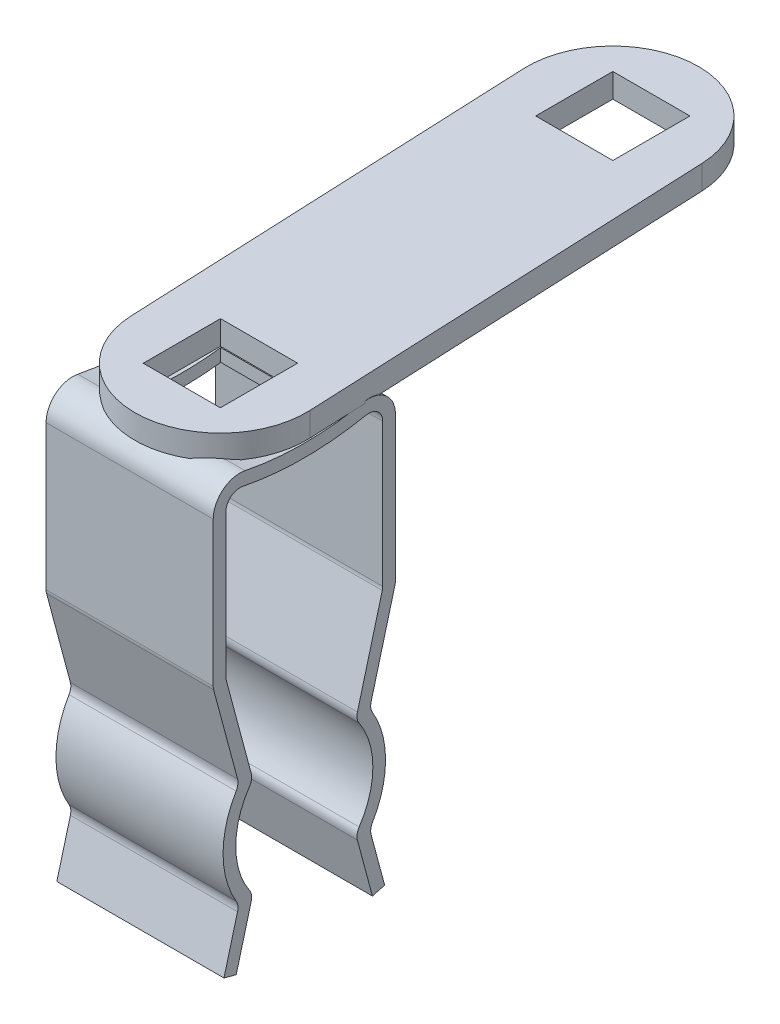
ISO-10303-21;
HEADER;
FILE_DESCRIPTION(('STEP AP214'),'2;1');
FILE_NAME('part.step','',(''),(''),'','','');
FILE_SCHEMA(('AUTOMOTIVE_DESIGN { 1 0 10303 214 1 1 1 1 }'));
ENDSEC;
DATA;
#1=APPLICATION_CONTEXT('core data for automotive mechanical design processes');
#2=APPLICATION_PROTOCOL_DEFINITION('international standard','automotive_design',2000,#1);
#3=PRODUCT_CONTEXT('',#1,'mechanical');
#4=PRODUCT('Part','Part','',(#3));
#5=PRODUCT_RELATED_PRODUCT_CATEGORY('part','',(#4));
#6=PRODUCT_DEFINITION_FORMATION('','',#4);
#7=PRODUCT_DEFINITION_CONTEXT('part definition',#1,'design');
#8=PRODUCT_DEFINITION('design','',#6,#7);
#9=PRODUCT_DEFINITION_SHAPE('','',#8);
#10=(LENGTH_UNIT() NAMED_UNIT(*) SI_UNIT(.MILLI.,.METRE.));
#11=(NAMED_UNIT(*) PLANE_ANGLE_UNIT() SI_UNIT($,.RADIAN.));
#12=(NAMED_UNIT(*) SI_UNIT($,.STERADIAN.) SOLID_ANGLE_UNIT());
#13=UNCERTAINTY_MEASURE_WITH_UNIT(LENGTH_MEASURE(1.E-05),#10,'distance_accuracy_value','');
#14=(GEOMETRIC_REPRESENTATION_CONTEXT(3) GLOBAL_UNCERTAINTY_ASSIGNED_CONTEXT((#13)) GLOBAL_UNIT_ASSIGNED_CONTEXT((#10,
#11,#12)) REPRESENTATION_CONTEXT('',''));
#15=CARTESIAN_POINT('',(0.,0.,0.));
#16=DIRECTION('',(0.,0.,1.));
#17=DIRECTION('',(1.,0.,0.));
#18=AXIS2_PLACEMENT_3D('',#15,#16,#17);
#19=CARTESIAN_POINT('',(5.0435,9.121795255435,11.02129570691));
#20=DIRECTION('',(0.,-0.965925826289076,0.258819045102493));
#21=DIRECTION('',(0.,-0.258819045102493,-0.965925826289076));
#22=AXIS2_PLACEMENT_3D('',#19,#20,#21);
#23=PLANE('',#22);
#24=DIRECTION('',(1.,0.,0.));
#25=VECTOR('',#24,1.);
#26=CARTESIAN_POINT('',(5.0435,9.12179525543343,11.0212957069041));
#27=LINE('',#26,#25);
#28=CARTESIAN_POINT('',(5.0435,9.12179525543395,11.0212957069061));
#29=VERTEX_POINT('',#28);
#30=CARTESIAN_POINT('',(9.9965,9.12179525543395,11.0212957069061));
#31=VERTEX_POINT('',#30);
#32=EDGE_CURVE('E546',#29,#31,#27,.T.);
#33=ORIENTED_EDGE('',*,*,#32,.F.);
#34=DIRECTION('',(0.,-0.258819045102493,-0.965925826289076));
#35=VECTOR('',#34,1.);
#36=CARTESIAN_POINT('',(5.0435,9.121795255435,11.02129570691));
#37=LINE('',#36,#35);
#38=CARTESIAN_POINT('',(5.0435,9.0244999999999,10.65818487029));
#39=VERTEX_POINT('',#38);
#40=EDGE_CURVE('E564',#29,#39,#37,.T.);
#41=ORIENTED_EDGE('',*,*,#40,.T.);
#42=DIRECTION('',(1.,0.,0.));
#43=VECTOR('',#42,1.);
#44=CARTESIAN_POINT('',(5.0435,9.0245,10.65818487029));
#45=LINE('',#44,#43);
#46=CARTESIAN_POINT('',(9.9965,9.0244999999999,10.65818487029));
#47=VERTEX_POINT('',#46);
#48=EDGE_CURVE('E532',#47,#39,#45,.F.);
#49=ORIENTED_EDGE('',*,*,#48,.F.);
#50=DIRECTION('',(0.,-0.258819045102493,-0.965925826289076));
#51=VECTOR('',#50,1.);
#52=CARTESIAN_POINT('',(9.9965,9.121795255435,11.02129570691));
#53=LINE('',#52,#51);
#54=EDGE_CURVE('E576',#47,#31,#53,.F.);
#55=ORIENTED_EDGE('',*,*,#54,.T.);
#56=EDGE_LOOP('',(#33,#41,#49,#55));
#57=FACE_BOUND('',#56,.T.);
#58=ADVANCED_FACE('F17',(#57),#23,.T.);
#59=CARTESIAN_POINT('',(5.0435,9.0245,6.621815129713));
#60=DIRECTION('',(0.,-0.965925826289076,-0.258819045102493));
#61=DIRECTION('',(0.,0.258819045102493,-0.965925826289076));
#62=AXIS2_PLACEMENT_3D('',#59,#60,#61);
#63=PLANE('',#62);
#64=DIRECTION('',(1.,0.,0.));
#65=VECTOR('',#64,1.);
#66=CARTESIAN_POINT('',(5.0435,9.02450000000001,6.62181512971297));
#67=LINE('',#66,#65);
#68=CARTESIAN_POINT('',(5.0435,9.02450000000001,6.62181512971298));
#69=VERTEX_POINT('',#68);
#70=CARTESIAN_POINT('',(9.9965,9.02450000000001,6.62181512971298));
#71=VERTEX_POINT('',#70);
#72=EDGE_CURVE('E518',#69,#71,#67,.T.);
#73=ORIENTED_EDGE('',*,*,#72,.F.);
#74=DIRECTION('',(0.,0.258819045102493,-0.965925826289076));
#75=VECTOR('',#74,1.);
#76=CARTESIAN_POINT('',(5.0435,9.0245,6.621815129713));
#77=LINE('',#76,#75);
#78=CARTESIAN_POINT('',(5.0435,9.12179525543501,6.258704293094));
#79=VERTEX_POINT('',#78);
#80=EDGE_CURVE('E552',#69,#79,#77,.T.);
#81=ORIENTED_EDGE('',*,*,#80,.T.);
#82=DIRECTION('',(1.,0.,0.));
#83=VECTOR('',#82,1.);
#84=CARTESIAN_POINT('',(5.0435,9.121795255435,6.258704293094));
#85=LINE('',#84,#83);
#86=CARTESIAN_POINT('',(9.9965,9.12179525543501,6.258704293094));
#87=VERTEX_POINT('',#86);
#88=EDGE_CURVE('E503',#87,#79,#85,.F.);
#89=ORIENTED_EDGE('',*,*,#88,.F.);
#90=DIRECTION('',(0.,0.258819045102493,-0.965925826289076));
#91=VECTOR('',#90,1.);
#92=CARTESIAN_POINT('',(9.9965,9.0245,6.621815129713));
#93=LINE('',#92,#91);
#94=EDGE_CURVE('E560',#87,#71,#93,.F.);
#95=ORIENTED_EDGE('',*,*,#94,.T.);
#96=EDGE_LOOP('',(#73,#81,#89,#95));
#97=FACE_BOUND('',#96,.T.);
#98=ADVANCED_FACE('F1111',(#97),#63,.T.);
#99=CARTESIAN_POINT('',(5.0435,10.78244212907,10.5763267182));
#100=DIRECTION('',(0.,0.258819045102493,0.965925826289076));
#101=DIRECTION('',(0.,-0.965925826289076,0.258819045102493));
#102=AXIS2_PLACEMENT_3D('',#99,#100,#101);
#103=PLANE('',#102);
#104=DIRECTION('',(0.,-0.965925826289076,0.258819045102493));
#105=VECTOR('',#104,1.);
#106=CARTESIAN_POINT('',(9.9965,10.78244212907,10.5763267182));
#107=LINE('',#106,#105);
#108=CARTESIAN_POINT('',(9.9965,10.6212990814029,10.6195048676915));
#109=VERTEX_POINT('',#108);
#110=EDGE_CURVE('E538',#31,#109,#107,.F.);
#111=ORIENTED_EDGE('',*,*,#110,.T.);
#112=DIRECTION('',(-1.,0.,0.));
#113=VECTOR('',#112,1.);
#114=CARTESIAN_POINT('',(5.023038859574,10.6212990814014,10.6195048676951));
#115=LINE('',#114,#113);
#116=CARTESIAN_POINT('',(5.0435,10.6212990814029,10.6195048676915));
#117=VERTEX_POINT('',#116);
#118=EDGE_CURVE('E541',#109,#117,#115,.T.);
#119=ORIENTED_EDGE('',*,*,#118,.T.);
#120=DIRECTION('',(0.,-0.965925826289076,0.258819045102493));
#121=VECTOR('',#120,1.);
#122=CARTESIAN_POINT('',(5.0435,10.78244212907,10.5763267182));
#123=LINE('',#122,#121);
#124=EDGE_CURVE('E549',#117,#29,#123,.T.);
#125=ORIENTED_EDGE('',*,*,#124,.T.);
#126=ORIENTED_EDGE('',*,*,#32,.T.);
#127=EDGE_LOOP('',(#111,#119,#125,#126));
#128=FACE_BOUND('',#127,.T.);
#129=ADVANCED_FACE('F782',(#128),#103,.T.);
#130=CARTESIAN_POINT('',(5.0435,9.0245,10.65818487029));
#131=DIRECTION('',(0.,-0.258819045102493,-0.965925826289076));
#132=DIRECTION('',(0.,0.965925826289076,-0.258819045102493));
#133=AXIS2_PLACEMENT_3D('',#130,#131,#132);
#134=PLANE('',#133);
#135=DIRECTION('',(0.,0.965925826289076,-0.258819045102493));
#136=VECTOR('',#135,1.);
#137=CARTESIAN_POINT('',(5.0435,9.0245,10.65818487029));
#138=LINE('',#137,#136);
#139=CARTESIAN_POINT('',(5.0435,10.6829135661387,10.2138142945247));
#140=VERTEX_POINT('',#139);
#141=EDGE_CURVE('E519',#39,#140,#138,.T.);
#142=ORIENTED_EDGE('',*,*,#141,.T.);
#143=DIRECTION('',(1.,0.,0.));
#144=VECTOR('',#143,1.);
#145=CARTESIAN_POINT('',(10.02044662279,10.6829135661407,10.2138142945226));
#146=LINE('',#145,#144);
#147=CARTESIAN_POINT('',(9.9965,10.6829135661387,10.2138142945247));
#148=VERTEX_POINT('',#147);
#149=EDGE_CURVE('E526',#148,#140,#146,.F.);
#150=ORIENTED_EDGE('',*,*,#149,.F.);
#151=DIRECTION('',(0.,0.965925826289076,-0.258819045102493));
#152=VECTOR('',#151,1.);
#153=CARTESIAN_POINT('',(9.9965,9.0245,10.65818487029));
#154=LINE('',#153,#152);
#155=EDGE_CURVE('E535',#148,#47,#154,.F.);
#156=ORIENTED_EDGE('',*,*,#155,.T.);
#157=ORIENTED_EDGE('',*,*,#48,.T.);
#158=EDGE_LOOP('',(#142,#150,#156,#157));
#159=FACE_BOUND('',#158,.T.);
#160=ADVANCED_FACE('F787',(#159),#134,.T.);
#161=CARTESIAN_POINT('',(5.0435,10.85791506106,7.113077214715));
#162=DIRECTION('',(0.,-0.258819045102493,0.965925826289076));
#163=DIRECTION('',(0.,-0.965925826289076,-0.258819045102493));
#164=AXIS2_PLACEMENT_3D('',#161,#162,#163);
#165=PLANE('',#164);
#166=DIRECTION('',(0.,-0.965925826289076,-0.258819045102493));
#167=VECTOR('',#166,1.);
#168=CARTESIAN_POINT('',(9.9965,10.85791506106,7.113077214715));
#169=LINE('',#168,#167);
#170=CARTESIAN_POINT('',(9.9965,10.6829135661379,7.06618570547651));
#171=VERTEX_POINT('',#170);
#172=EDGE_CURVE('E504',#71,#171,#169,.F.);
#173=ORIENTED_EDGE('',*,*,#172,.T.);
#174=DIRECTION('',(1.,0.,0.));
#175=VECTOR('',#174,1.);
#176=CARTESIAN_POINT('',(10.02044662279,10.6829135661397,7.06618570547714));
#177=LINE('',#176,#175);
#178=CARTESIAN_POINT('',(5.0435,10.6829135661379,7.06618570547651));
#179=VERTEX_POINT('',#178);
#180=EDGE_CURVE('E511',#179,#171,#177,.T.);
#181=ORIENTED_EDGE('',*,*,#180,.F.);
#182=DIRECTION('',(0.,-0.965925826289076,-0.258819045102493));
#183=VECTOR('',#182,1.);
#184=CARTESIAN_POINT('',(5.0435,10.85791506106,7.113077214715));
#185=LINE('',#184,#183);
#186=EDGE_CURVE('E515',#179,#69,#185,.T.);
#187=ORIENTED_EDGE('',*,*,#186,.T.);
#188=ORIENTED_EDGE('',*,*,#72,.T.);
#189=EDGE_LOOP('',(#173,#181,#187,#188));
#190=FACE_BOUND('',#189,.T.);
#191=ADVANCED_FACE('F1103',(#190),#165,.T.);
#192=CARTESIAN_POINT('',(5.0435,9.121795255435,6.258704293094));
#193=DIRECTION('',(0.,0.258819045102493,-0.965925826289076));
#194=DIRECTION('',(0.,0.965925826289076,0.258819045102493));
#195=AXIS2_PLACEMENT_3D('',#192,#193,#194);
#196=PLANE('',#195);
#197=DIRECTION('',(0.,0.965925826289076,0.258819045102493));
#198=VECTOR('',#197,1.);
#199=CARTESIAN_POINT('',(5.0435,9.121795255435,6.258704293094));
#200=LINE('',#199,#198);
#201=CARTESIAN_POINT('',(5.0435,10.6212990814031,6.66049513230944));
#202=VERTEX_POINT('',#201);
#203=EDGE_CURVE('E386',#79,#202,#200,.T.);
#204=ORIENTED_EDGE('',*,*,#203,.T.);
#205=DIRECTION('',(-1.,0.,0.));
#206=VECTOR('',#205,1.);
#207=CARTESIAN_POINT('',(5.023038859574,10.6212990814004,6.66049513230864));
#208=LINE('',#207,#206);
#209=CARTESIAN_POINT('',(9.9965,10.6212990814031,6.66049513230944));
#210=VERTEX_POINT('',#209);
#211=EDGE_CURVE('E495',#202,#210,#208,.F.);
#212=ORIENTED_EDGE('',*,*,#211,.T.);
#213=DIRECTION('',(0.,0.965925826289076,0.258819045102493));
#214=VECTOR('',#213,1.);
#215=CARTESIAN_POINT('',(9.9965,9.121795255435,6.258704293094));
#216=LINE('',#215,#214);
#217=EDGE_CURVE('E500',#210,#87,#216,.F.);
#218=ORIENTED_EDGE('',*,*,#217,.T.);
#219=ORIENTED_EDGE('',*,*,#88,.T.);
#220=EDGE_LOOP('',(#204,#212,#218,#219));
#221=FACE_BOUND('',#220,.T.);
#222=ADVANCED_FACE('F1100',(#221),#196,.T.);
#223=CARTESIAN_POINT('',(5.023038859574,13.93309086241,10.98752260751));
#224=DIRECTION('',(-1.,0.,0.));
#225=DIRECTION('',(0.,0.,1.));
#226=AXIS2_PLACEMENT_3D('',#223,#224,#225);
#227=CYLINDRICAL_SURFACE('',#226,0.381);
#228=DIRECTION('',(1.,0.,0.));
#229=VECTOR('',#228,1.);
#230=CARTESIAN_POINT('',(5.0435,14.0317009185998,10.6195048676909));
#231=LINE('',#230,#229);
#232=CARTESIAN_POINT('',(5.0435,14.0317009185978,10.6195048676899));
#233=VERTEX_POINT('',#232);
#234=CARTESIAN_POINT('',(9.9965,14.0317009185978,10.6195048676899));
#235=VERTEX_POINT('',#234);
#236=EDGE_CURVE('E388',#233,#235,#231,.T.);
#237=ORIENTED_EDGE('',*,*,#236,.F.);
#238=CARTESIAN_POINT('',(5.0435,13.93309086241,10.98752260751));
#239=DIRECTION('',(-1.,0.,0.));
#240=DIRECTION('',(0.,0.,1.));
#241=AXIS2_PLACEMENT_3D('',#238,#239,#240);
#242=CIRCLE('',#241,0.381);
#243=CARTESIAN_POINT('',(5.0435,13.7384312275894,10.660003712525));
#244=VERTEX_POINT('',#243);
#245=EDGE_CURVE('E20',#244,#233,#242,.F.);
#246=ORIENTED_EDGE('',*,*,#245,.F.);
#247=DIRECTION('',(-1.,0.,0.));
#248=VECTOR('',#247,1.);
#249=CARTESIAN_POINT('',(5.0435,13.7384312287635,10.6600037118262));
#250=LINE('',#249,#248);
#251=CARTESIAN_POINT('',(9.9965,13.7384312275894,10.660003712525));
#252=VERTEX_POINT('',#251);
#253=EDGE_CURVE('E490',#252,#244,#250,.T.);
#254=ORIENTED_EDGE('',*,*,#253,.F.);
#255=CARTESIAN_POINT('',(9.9965,13.93309086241,10.98752260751));
#256=DIRECTION('',(-1.,0.,0.));
#257=DIRECTION('',(0.,0.,1.));
#258=AXIS2_PLACEMENT_3D('',#255,#256,#257);
#259=CIRCLE('',#258,0.381);
#260=EDGE_CURVE('E385',#235,#252,#259,.T.);
#261=ORIENTED_EDGE('',*,*,#260,.F.);
#262=EDGE_LOOP('',(#237,#246,#254,#261));
#263=FACE_BOUND('',#262,.T.);
#264=ADVANCED_FACE('F389',(#263),#227,.F.);
#265=CARTESIAN_POINT('',(5.023038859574,10.71990913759,10.98752260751));
#266=DIRECTION('',(-1.,0.,0.));
#267=DIRECTION('',(0.,0.,1.));
#268=AXIS2_PLACEMENT_3D('',#265,#266,#267);
#269=CYLINDRICAL_SURFACE('',#268,0.381);
#270=DIRECTION('',(-1.,0.,0.));
#271=VECTOR('',#270,1.);
#272=CARTESIAN_POINT('',(5.0435,10.9145687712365,10.6600037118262));
#273=LINE('',#272,#271);
#274=CARTESIAN_POINT('',(5.0435,10.9145687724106,10.660003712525));
#275=VERTEX_POINT('',#274);
#276=CARTESIAN_POINT('',(9.9965,10.9145687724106,10.660003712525));
#277=VERTEX_POINT('',#276);
#278=EDGE_CURVE('E485',#275,#277,#273,.F.);
#279=ORIENTED_EDGE('',*,*,#278,.F.);
#280=CARTESIAN_POINT('',(5.0435,10.71990913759,10.98752260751));
#281=DIRECTION('',(-1.,0.,0.));
#282=DIRECTION('',(0.,0.,1.));
#283=AXIS2_PLACEMENT_3D('',#280,#281,#282);
#284=CIRCLE('',#283,0.381);
#285=EDGE_CURVE('E544',#117,#275,#284,.F.);
#286=ORIENTED_EDGE('',*,*,#285,.F.);
#287=ORIENTED_EDGE('',*,*,#118,.F.);
#288=CARTESIAN_POINT('',(9.9965,10.71990913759,10.98752260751));
#289=DIRECTION('',(-1.,0.,0.));
#290=DIRECTION('',(0.,0.,1.));
#291=AXIS2_PLACEMENT_3D('',#288,#289,#290);
#292=CIRCLE('',#291,0.381);
#293=EDGE_CURVE('E764',#277,#109,#292,.T.);
#294=ORIENTED_EDGE('',*,*,#293,.F.);
#295=EDGE_LOOP('',(#279,#286,#287,#294));
#296=FACE_BOUND('',#295,.T.);
#297=ADVANCED_FACE('F776',(#296),#269,.F.);
#298=CARTESIAN_POINT('',(10.02044662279,10.78152362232,10.58183203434));
#299=DIRECTION('',(1.,0.,0.));
#300=DIRECTION('',(0.,0.,-1.));
#301=AXIS2_PLACEMENT_3D('',#298,#299,#300);
#302=CYLINDRICAL_SURFACE('',#301,0.381);
#303=CARTESIAN_POINT('',(5.0435,10.78152362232,10.58183203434));
#304=DIRECTION('',(1.,0.,0.));
#305=DIRECTION('',(0.,0.,-1.));
#306=AXIS2_PLACEMENT_3D('',#303,#304,#305);
#307=CIRCLE('',#306,0.381);
#308=CARTESIAN_POINT('',(5.0435,10.9941350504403,10.2656716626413));
#309=VERTEX_POINT('',#308);
#310=EDGE_CURVE('E529',#140,#309,#307,.T.);
#311=ORIENTED_EDGE('',*,*,#310,.T.);
#312=DIRECTION('',(-1.,0.,0.));
#313=VECTOR('',#312,1.);
#314=CARTESIAN_POINT('',(5.0435,10.9941350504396,10.2656716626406));
#315=LINE('',#314,#313);
#316=CARTESIAN_POINT('',(9.9965,10.9941350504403,10.2656716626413));
#317=VERTEX_POINT('',#316);
#318=EDGE_CURVE('E482',#309,#317,#315,.F.);
#319=ORIENTED_EDGE('',*,*,#318,.T.);
#320=CARTESIAN_POINT('',(9.9965,10.78152362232,10.58183203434));
#321=DIRECTION('',(1.,0.,0.));
#322=DIRECTION('',(0.,0.,-1.));
#323=AXIS2_PLACEMENT_3D('',#320,#321,#322);
#324=CIRCLE('',#323,0.381);
#325=EDGE_CURVE('E530',#317,#148,#324,.F.);
#326=ORIENTED_EDGE('',*,*,#325,.T.);
#327=ORIENTED_EDGE('',*,*,#149,.T.);
#328=EDGE_LOOP('',(#311,#319,#326,#327));
#329=FACE_BOUND('',#328,.T.);
#330=ADVANCED_FACE('F791',(#329),#302,.T.);
#331=CARTESIAN_POINT('',(10.02044662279,13.87147637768,10.58183203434));
#332=DIRECTION('',(1.,0.,0.));
#333=DIRECTION('',(0.,0.,-1.));
#334=AXIS2_PLACEMENT_3D('',#331,#332,#333);
#335=CYLINDRICAL_SURFACE('',#334,0.381);
#336=CARTESIAN_POINT('',(5.0435,13.87147637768,10.58183203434));
#337=DIRECTION('',(1.,0.,0.));
#338=DIRECTION('',(0.,0.,-1.));
#339=AXIS2_PLACEMENT_3D('',#336,#337,#338);
#340=CIRCLE('',#339,0.381);
#341=CARTESIAN_POINT('',(5.0435,13.6588649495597,10.2656716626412));
#342=VERTEX_POINT('',#341);
#343=CARTESIAN_POINT('',(5.0435,13.970086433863,10.2138142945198));
#344=VERTEX_POINT('',#343);
#345=EDGE_CURVE('E757',#342,#344,#340,.T.);
#346=ORIENTED_EDGE('',*,*,#345,.T.);
#347=DIRECTION('',(1.,0.,0.));
#348=VECTOR('',#347,1.);
#349=CARTESIAN_POINT('',(5.0435,13.9700864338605,10.2138142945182));
#350=LINE('',#349,#348);
#351=CARTESIAN_POINT('',(9.9965,13.970086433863,10.2138142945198));
#352=VERTEX_POINT('',#351);
#353=EDGE_CURVE('E475',#352,#344,#350,.F.);
#354=ORIENTED_EDGE('',*,*,#353,.F.);
#355=CARTESIAN_POINT('',(9.9965,13.87147637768,10.58183203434));
#356=DIRECTION('',(1.,0.,0.));
#357=DIRECTION('',(0.,0.,-1.));
#358=AXIS2_PLACEMENT_3D('',#355,#356,#357);
#359=CIRCLE('',#358,0.381);
#360=CARTESIAN_POINT('',(9.9965,13.6588649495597,10.2656716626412));
#361=VERTEX_POINT('',#360);
#362=EDGE_CURVE('E759',#352,#361,#359,.F.);
#363=ORIENTED_EDGE('',*,*,#362,.T.);
#364=DIRECTION('',(-1.,0.,0.));
#365=VECTOR('',#364,1.);
#366=CARTESIAN_POINT('',(5.0435,13.6588649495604,10.2656716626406));
#367=LINE('',#366,#365);
#368=EDGE_CURVE('E481',#361,#342,#367,.T.);
#369=ORIENTED_EDGE('',*,*,#368,.T.);
#370=EDGE_LOOP('',(#346,#354,#363,#369));
#371=FACE_BOUND('',#370,.T.);
#372=ADVANCED_FACE('F798',(#371),#335,.T.);
#373=CARTESIAN_POINT('',(5.023038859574,16.82035040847,10.5831));
#374=DIRECTION('',(-1.,0.,0.));
#375=DIRECTION('',(0.,0.,1.));
#376=AXIS2_PLACEMENT_3D('',#373,#374,#375);
#377=CYLINDRICAL_SURFACE('',#376,0.381);
#378=DIRECTION('',(1.,0.,0.));
#379=VECTOR('',#378,1.);
#380=CARTESIAN_POINT('',(5.0435,16.7217403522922,10.9511177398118));
#381=LINE('',#380,#379);
#382=CARTESIAN_POINT('',(5.0435,16.7217403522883,10.9511177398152));
#383=VERTEX_POINT('',#382);
#384=CARTESIAN_POINT('',(9.9965,16.7217403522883,10.9511177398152));
#385=VERTEX_POINT('',#384);
#386=EDGE_CURVE('E478',#383,#385,#381,.T.);
#387=ORIENTED_EDGE('',*,*,#386,.F.);
#388=CARTESIAN_POINT('',(5.0435,16.82035040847,10.5831));
#389=DIRECTION('',(-1.,0.,0.));
#390=DIRECTION('',(0.,0.,1.));
#391=AXIS2_PLACEMENT_3D('',#388,#389,#390);
#392=CIRCLE('',#391,0.381);
#393=CARTESIAN_POINT('',(5.0435,16.82035040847,10.9641));
#394=VERTEX_POINT('',#393);
#395=EDGE_CURVE('E755',#394,#383,#392,.F.);
#396=ORIENTED_EDGE('',*,*,#395,.F.);
#397=DIRECTION('',(-1.,0.,0.));
#398=VECTOR('',#397,1.);
#399=CARTESIAN_POINT('',(5.0435,16.82035040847,10.9641));
#400=LINE('',#399,#398);
#401=CARTESIAN_POINT('',(9.9965,16.82035040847,10.9641));
#402=VERTEX_POINT('',#401);
#403=EDGE_CURVE('E462',#402,#394,#400,.T.);
#404=ORIENTED_EDGE('',*,*,#403,.F.);
#405=CARTESIAN_POINT('',(9.9965,16.82035040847,10.5831));
#406=DIRECTION('',(-1.,0.,0.));
#407=DIRECTION('',(0.,0.,1.));
#408=AXIS2_PLACEMENT_3D('',#405,#406,#407);
#409=CIRCLE('',#408,0.381);
#410=EDGE_CURVE('E753',#385,#402,#409,.T.);
#411=ORIENTED_EDGE('',*,*,#410,.F.);
#412=EDGE_LOOP('',(#387,#396,#404,#411));
#413=FACE_BOUND('',#412,.T.);
#414=ADVANCED_FACE('F831',(#413),#377,.F.);
#415=CARTESIAN_POINT('',(5.023038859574,16.82035040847,6.6969));
#416=DIRECTION('',(-1.,0.,0.));
#417=DIRECTION('',(0.,0.,1.));
#418=AXIS2_PLACEMENT_3D('',#415,#416,#417);
#419=CYLINDRICAL_SURFACE('',#418,0.381);
#420=DIRECTION('',(1.,0.,0.));
#421=VECTOR('',#420,1.);
#422=CARTESIAN_POINT('',(5.0435,16.82035040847,6.3159));
#423=LINE('',#422,#421);
#424=CARTESIAN_POINT('',(5.0435,16.82035040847,6.3159));
#425=VERTEX_POINT('',#424);
#426=CARTESIAN_POINT('',(9.9965,16.82035040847,6.3159));
#427=VERTEX_POINT('',#426);
#428=EDGE_CURVE('E456',#425,#427,#423,.T.);
#429=ORIENTED_EDGE('',*,*,#428,.F.);
#430=CARTESIAN_POINT('',(5.0435,16.82035040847,6.6969));
#431=DIRECTION('',(-1.,0.,0.));
#432=DIRECTION('',(0.,0.,1.));
#433=AXIS2_PLACEMENT_3D('',#430,#431,#432);
#434=CIRCLE('',#433,0.381);
#435=CARTESIAN_POINT('',(5.0435,16.7217403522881,6.32888226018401));
#436=VERTEX_POINT('',#435);
#437=EDGE_CURVE('E751',#436,#425,#434,.F.);
#438=ORIENTED_EDGE('',*,*,#437,.F.);
#439=DIRECTION('',(1.,0.,0.));
#440=VECTOR('',#439,1.);
#441=CARTESIAN_POINT('',(5.0435,16.7217403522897,6.32888226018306));
#442=LINE('',#441,#440);
#443=CARTESIAN_POINT('',(9.9965,16.7217403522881,6.32888226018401));
#444=VERTEX_POINT('',#443);
#445=EDGE_CURVE('E453',#444,#436,#442,.F.);
#446=ORIENTED_EDGE('',*,*,#445,.F.);
#447=CARTESIAN_POINT('',(9.9965,16.82035040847,6.6969));
#448=DIRECTION('',(-1.,0.,0.));
#449=DIRECTION('',(0.,0.,1.));
#450=AXIS2_PLACEMENT_3D('',#447,#448,#449);
#451=CIRCLE('',#450,0.381);
#452=EDGE_CURVE('E749',#427,#444,#451,.T.);
#453=ORIENTED_EDGE('',*,*,#452,.F.);
#454=EDGE_LOOP('',(#429,#438,#446,#453));
#455=FACE_BOUND('',#454,.T.);
#456=ADVANCED_FACE('F1085',(#455),#419,.F.);
#457=CARTESIAN_POINT('',(10.02044662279,13.87147637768,6.69816796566));
#458=DIRECTION('',(1.,0.,0.));
#459=DIRECTION('',(0.,0.,-1.));
#460=AXIS2_PLACEMENT_3D('',#457,#458,#459);
#461=CYLINDRICAL_SURFACE('',#460,0.381);
#462=CARTESIAN_POINT('',(5.0435,13.87147637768,6.69816796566));
#463=DIRECTION('',(1.,0.,0.));
#464=DIRECTION('',(0.,0.,-1.));
#465=AXIS2_PLACEMENT_3D('',#462,#463,#464);
#466=CIRCLE('',#465,0.381);
#467=CARTESIAN_POINT('',(5.0435,13.9700864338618,7.06618570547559));
#468=VERTEX_POINT('',#467);
#469=CARTESIAN_POINT('',(5.0435,13.6588649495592,7.01432833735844));
#470=VERTEX_POINT('',#469);
#471=EDGE_CURVE('E745',#468,#470,#466,.T.);
#472=ORIENTED_EDGE('',*,*,#471,.T.);
#473=DIRECTION('',(-1.,0.,0.));
#474=VECTOR('',#473,1.);
#475=CARTESIAN_POINT('',(5.0435,13.6588649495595,7.01432833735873));
#476=LINE('',#475,#474);
#477=CARTESIAN_POINT('',(9.9965,13.6588649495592,7.01432833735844));
#478=VERTEX_POINT('',#477);
#479=EDGE_CURVE('E447',#470,#478,#476,.F.);
#480=ORIENTED_EDGE('',*,*,#479,.T.);
#481=CARTESIAN_POINT('',(9.9965,13.87147637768,6.69816796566));
#482=DIRECTION('',(1.,0.,0.));
#483=DIRECTION('',(0.,0.,-1.));
#484=AXIS2_PLACEMENT_3D('',#481,#482,#483);
#485=CIRCLE('',#484,0.381);
#486=CARTESIAN_POINT('',(9.9965,13.9700864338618,7.06618570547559));
#487=VERTEX_POINT('',#486);
#488=EDGE_CURVE('E747',#478,#487,#485,.F.);
#489=ORIENTED_EDGE('',*,*,#488,.T.);
#490=DIRECTION('',(1.,0.,0.));
#491=VECTOR('',#490,1.);
#492=CARTESIAN_POINT('',(5.0435,13.97008643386,7.06618570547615));
#493=LINE('',#492,#491);
#494=EDGE_CURVE('E450',#468,#487,#493,.T.);
#495=ORIENTED_EDGE('',*,*,#494,.F.);
#496=EDGE_LOOP('',(#472,#480,#489,#495));
#497=FACE_BOUND('',#496,.T.);
#498=ADVANCED_FACE('F1081',(#497),#461,.T.);
#499=CARTESIAN_POINT('',(10.02044662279,10.78152362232,6.69816796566));
#500=DIRECTION('',(1.,0.,0.));
#501=DIRECTION('',(0.,0.,-1.));
#502=AXIS2_PLACEMENT_3D('',#499,#500,#501);
#503=CYLINDRICAL_SURFACE('',#502,0.381);
#504=CARTESIAN_POINT('',(5.0435,10.78152362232,6.69816796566));
#505=DIRECTION('',(1.,0.,0.));
#506=DIRECTION('',(0.,0.,-1.));
#507=AXIS2_PLACEMENT_3D('',#504,#505,#506);
#508=CIRCLE('',#507,0.381);
#509=CARTESIAN_POINT('',(5.0435,10.9941350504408,7.01432833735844));
#510=VERTEX_POINT('',#509);
#511=EDGE_CURVE('E514',#510,#179,#508,.T.);
#512=ORIENTED_EDGE('',*,*,#511,.T.);
#513=ORIENTED_EDGE('',*,*,#180,.T.);
#514=CARTESIAN_POINT('',(9.9965,10.78152362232,6.69816796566));
#515=DIRECTION('',(1.,0.,0.));
#516=DIRECTION('',(0.,0.,-1.));
#517=AXIS2_PLACEMENT_3D('',#514,#515,#516);
#518=CIRCLE('',#517,0.381);
#519=CARTESIAN_POINT('',(9.9965,10.9941350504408,7.01432833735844));
#520=VERTEX_POINT('',#519);
#521=EDGE_CURVE('E743',#171,#520,#518,.F.);
#522=ORIENTED_EDGE('',*,*,#521,.T.);
#523=DIRECTION('',(-1.,0.,0.));
#524=VECTOR('',#523,1.);
#525=CARTESIAN_POINT('',(5.0435,10.9941350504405,7.01432833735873));
#526=LINE('',#525,#524);
#527=EDGE_CURVE('E446',#520,#510,#526,.T.);
#528=ORIENTED_EDGE('',*,*,#527,.T.);
#529=EDGE_LOOP('',(#512,#513,#522,#528));
#530=FACE_BOUND('',#529,.T.);
#531=ADVANCED_FACE('F1077',(#530),#503,.T.);
#532=CARTESIAN_POINT('',(5.023038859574,10.71990913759,6.292477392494));
#533=DIRECTION('',(-1.,0.,0.));
#534=DIRECTION('',(0.,0.,1.));
#535=AXIS2_PLACEMENT_3D('',#532,#533,#534);
#536=CYLINDRICAL_SURFACE('',#535,0.381);
#537=ORIENTED_EDGE('',*,*,#211,.F.);
#538=CARTESIAN_POINT('',(5.0435,10.71990913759,6.292477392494));
#539=DIRECTION('',(-1.,0.,0.));
#540=DIRECTION('',(0.,0.,1.));
#541=AXIS2_PLACEMENT_3D('',#538,#539,#540);
#542=CIRCLE('',#541,0.381);
#543=CARTESIAN_POINT('',(5.0435,10.9145687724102,6.61999628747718));
#544=VERTEX_POINT('',#543);
#545=EDGE_CURVE('E499',#544,#202,#542,.F.);
#546=ORIENTED_EDGE('',*,*,#545,.F.);
#547=DIRECTION('',(-1.,0.,0.));
#548=VECTOR('',#547,1.);
#549=CARTESIAN_POINT('',(5.0435,10.9145687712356,6.61999628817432));
#550=LINE('',#549,#548);
#551=CARTESIAN_POINT('',(9.9965,10.9145687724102,6.61999628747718));
#552=VERTEX_POINT('',#551);
#553=EDGE_CURVE('E443',#552,#544,#550,.T.);
#554=ORIENTED_EDGE('',*,*,#553,.F.);
#555=CARTESIAN_POINT('',(9.9965,10.71990913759,6.292477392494));
#556=DIRECTION('',(-1.,0.,0.));
#557=DIRECTION('',(0.,0.,1.));
#558=AXIS2_PLACEMENT_3D('',#555,#556,#557);
#559=CIRCLE('',#558,0.381);
#560=EDGE_CURVE('E498',#210,#552,#559,.T.);
#561=ORIENTED_EDGE('',*,*,#560,.F.);
#562=EDGE_LOOP('',(#537,#546,#554,#561));
#563=FACE_BOUND('',#562,.T.);
#564=ADVANCED_FACE('F1073',(#563),#536,.F.);
#565=CARTESIAN_POINT('',(5.023038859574,13.93309086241,6.292477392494));
#566=DIRECTION('',(-1.,0.,0.));
#567=DIRECTION('',(0.,0.,1.));
#568=AXIS2_PLACEMENT_3D('',#565,#566,#567);
#569=CYLINDRICAL_SURFACE('',#568,0.381);
#570=DIRECTION('',(-1.,0.,0.));
#571=VECTOR('',#570,1.);
#572=CARTESIAN_POINT('',(5.0435,13.7384312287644,6.61999628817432));
#573=LINE('',#572,#571);
#574=CARTESIAN_POINT('',(5.0435,13.7384312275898,6.61999628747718));
#575=VERTEX_POINT('',#574);
#576=CARTESIAN_POINT('',(9.9965,13.7384312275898,6.61999628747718));
#577=VERTEX_POINT('',#576);
#578=EDGE_CURVE('E437',#575,#577,#573,.F.);
#579=ORIENTED_EDGE('',*,*,#578,.F.);
#580=CARTESIAN_POINT('',(5.0435,13.93309086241,6.292477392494));
#581=DIRECTION('',(-1.,0.,0.));
#582=DIRECTION('',(0.,0.,1.));
#583=AXIS2_PLACEMENT_3D('',#580,#581,#582);
#584=CIRCLE('',#583,0.381);
#585=CARTESIAN_POINT('',(5.0435,14.0317009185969,6.66049513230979));
#586=VERTEX_POINT('',#585);
#587=EDGE_CURVE('E737',#586,#575,#584,.F.);
#588=ORIENTED_EDGE('',*,*,#587,.F.);
#589=DIRECTION('',(1.,0.,0.));
#590=VECTOR('',#589,1.);
#591=CARTESIAN_POINT('',(5.0435,14.0317009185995,6.66049513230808));
#592=LINE('',#591,#590);
#593=CARTESIAN_POINT('',(9.9965,14.0317009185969,6.66049513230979));
#594=VERTEX_POINT('',#593);
#595=EDGE_CURVE('E433',#594,#586,#592,.F.);
#596=ORIENTED_EDGE('',*,*,#595,.F.);
#597=CARTESIAN_POINT('',(9.9965,13.93309086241,6.292477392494));
#598=DIRECTION('',(-1.,0.,0.));
#599=DIRECTION('',(0.,0.,1.));
#600=AXIS2_PLACEMENT_3D('',#597,#598,#599);
#601=CIRCLE('',#600,0.381);
#602=EDGE_CURVE('E735',#577,#594,#601,.T.);
#603=ORIENTED_EDGE('',*,*,#602,.F.);
#604=EDGE_LOOP('',(#579,#588,#596,#603));
#605=FACE_BOUND('',#604,.T.);
#606=ADVANCED_FACE('F1070',(#605),#569,.F.);
#607=CARTESIAN_POINT('',(5.0435,21.05902,6.72738));
#608=DIRECTION('',(-1.,0.,0.));
#609=DIRECTION('',(0.,0.,1.));
#610=AXIS2_PLACEMENT_3D('',#607,#608,#609);
#611=CYLINDRICAL_SURFACE('',#610,0.41148);
#612=CARTESIAN_POINT('',(9.9965,21.05902,6.72738));
#613=DIRECTION('',(-1.,0.,0.));
#614=DIRECTION('',(0.,0.,1.));
#615=AXIS2_PLACEMENT_3D('',#612,#613,#614);
#616=CIRCLE('',#615,0.41148);
#617=CARTESIAN_POINT('',(9.9965,21.4624160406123,6.80854295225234));
#618=VERTEX_POINT('',#617);
#619=CARTESIAN_POINT('',(9.9965,21.05902,6.3159));
#620=VERTEX_POINT('',#619);
#621=EDGE_CURVE('E731',#618,#620,#616,.T.);
#622=ORIENTED_EDGE('',*,*,#621,.F.);
#623=DIRECTION('',(-1.,0.,0.));
#624=VECTOR('',#623,1.);
#625=CARTESIAN_POINT('',(5.0435,21.4624160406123,6.80854295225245));
#626=LINE('',#625,#624);
#627=CARTESIAN_POINT('',(5.0435,21.4624160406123,6.80854295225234));
#628=VERTEX_POINT('',#627);
#629=EDGE_CURVE('E440',#628,#618,#626,.F.);
#630=ORIENTED_EDGE('',*,*,#629,.F.);
#631=CARTESIAN_POINT('',(5.0435,21.05902,6.72738));
#632=DIRECTION('',(-1.,0.,0.));
#633=DIRECTION('',(0.,0.,1.));
#634=AXIS2_PLACEMENT_3D('',#631,#632,#633);
#635=CIRCLE('',#634,0.41148);
#636=CARTESIAN_POINT('',(5.0435,21.05902,6.3159));
#637=VERTEX_POINT('',#636);
#638=EDGE_CURVE('E733',#637,#628,#635,.F.);
#639=ORIENTED_EDGE('',*,*,#638,.F.);
#640=DIRECTION('',(1.,0.,0.));
#641=VECTOR('',#640,1.);
#642=CARTESIAN_POINT('',(5.0435,21.05902,6.3159));
#643=LINE('',#642,#641);
#644=EDGE_CURVE('E459',#620,#637,#643,.F.);
#645=ORIENTED_EDGE('',*,*,#644,.F.);
#646=EDGE_LOOP('',(#622,#630,#639,#645));
#647=FACE_BOUND('',#646,.T.);
#648=ADVANCED_FACE('F844',(#647),#611,.F.);
#649=CARTESIAN_POINT('',(5.0435,21.05902,10.55262));
#650=DIRECTION('',(-1.,0.,0.));
#651=DIRECTION('',(0.,0.,1.));
#652=AXIS2_PLACEMENT_3D('',#649,#650,#651);
#653=CYLINDRICAL_SURFACE('',#652,0.41148);
#654=CARTESIAN_POINT('',(9.9965,21.05902,10.55262));
#655=DIRECTION('',(-1.,0.,0.));
#656=DIRECTION('',(0.,0.,1.));
#657=AXIS2_PLACEMENT_3D('',#654,#655,#656);
#658=CIRCLE('',#657,0.41148);
#659=CARTESIAN_POINT('',(9.9965,21.05902,10.9641));
#660=VERTEX_POINT('',#659);
#661=CARTESIAN_POINT('',(9.9965,21.4624160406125,10.4714570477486));
#662=VERTEX_POINT('',#661);
#663=EDGE_CURVE('E727',#660,#662,#658,.T.);
#664=ORIENTED_EDGE('',*,*,#663,.F.);
#665=DIRECTION('',(-1.,0.,0.));
#666=VECTOR('',#665,1.);
#667=CARTESIAN_POINT('',(5.0435,21.05902,10.9641));
#668=LINE('',#667,#666);
#669=CARTESIAN_POINT('',(5.0435,21.05902,10.9641));
#670=VERTEX_POINT('',#669);
#671=EDGE_CURVE('E472',#670,#660,#668,.F.);
#672=ORIENTED_EDGE('',*,*,#671,.F.);
#673=CARTESIAN_POINT('',(5.0435,21.05902,10.55262));
#674=DIRECTION('',(-1.,0.,0.));
#675=DIRECTION('',(0.,0.,1.));
#676=AXIS2_PLACEMENT_3D('',#673,#674,#675);
#677=CIRCLE('',#676,0.41148);
#678=CARTESIAN_POINT('',(5.0435,21.4624160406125,10.4714570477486));
#679=VERTEX_POINT('',#678);
#680=EDGE_CURVE('E729',#679,#670,#677,.F.);
#681=ORIENTED_EDGE('',*,*,#680,.F.);
#682=DIRECTION('',(-1.,0.,0.));
#683=VECTOR('',#682,1.);
#684=CARTESIAN_POINT('',(5.0435,21.4624160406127,10.4714570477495));
#685=LINE('',#684,#683);
#686=EDGE_CURVE('E467',#662,#679,#685,.T.);
#687=ORIENTED_EDGE('',*,*,#686,.F.);
#688=EDGE_LOOP('',(#664,#672,#681,#687));
#689=FACE_BOUND('',#688,.T.);
#690=ADVANCED_FACE('F838',(#689),#653,.F.);
#691=CARTESIAN_POINT('',(10.02044662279,16.77085960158,10.95902));
#692=DIRECTION('',(1.,0.,0.));
#693=DIRECTION('',(0.,0.,-1.));
#694=AXIS2_PLACEMENT_3D('',#691,#692,#693);
#695=CYLINDRICAL_SURFACE('',#694,0.381);
#696=CARTESIAN_POINT('',(5.0435,16.77085960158,10.95902));
#697=DIRECTION('',(1.,0.,0.));
#698=DIRECTION('',(0.,0.,-1.));
#699=AXIS2_PLACEMENT_3D('',#696,#697,#698);
#700=CIRCLE('',#699,0.381);
#701=CARTESIAN_POINT('',(5.0435,16.77085960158,11.34002));
#702=VERTEX_POINT('',#701);
#703=CARTESIAN_POINT('',(5.0435,16.6722495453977,11.3270377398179));
#704=VERTEX_POINT('',#703);
#705=EDGE_CURVE('E723',#702,#704,#700,.T.);
#706=ORIENTED_EDGE('',*,*,#705,.T.);
#707=DIRECTION('',(1.,0.,0.));
#708=VECTOR('',#707,1.);
#709=CARTESIAN_POINT('',(5.0435,16.6722495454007,11.3270377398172));
#710=LINE('',#709,#708);
#711=CARTESIAN_POINT('',(9.9965,16.6722495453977,11.3270377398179));
#712=VERTEX_POINT('',#711);
#713=EDGE_CURVE('E393',#712,#704,#710,.F.);
#714=ORIENTED_EDGE('',*,*,#713,.F.);
#715=CARTESIAN_POINT('',(9.9965,16.77085960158,10.95902));
#716=DIRECTION('',(1.,0.,0.));
#717=DIRECTION('',(0.,0.,-1.));
#718=AXIS2_PLACEMENT_3D('',#715,#716,#717);
#719=CIRCLE('',#718,0.381);
#720=CARTESIAN_POINT('',(9.9965,16.77085960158,11.34002));
#721=VERTEX_POINT('',#720);
#722=EDGE_CURVE('E725',#712,#721,#719,.F.);
#723=ORIENTED_EDGE('',*,*,#722,.T.);
#724=DIRECTION('',(1.,0.,0.));
#725=VECTOR('',#724,1.);
#726=CARTESIAN_POINT('',(5.0435,16.77085960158,11.34002));
#727=LINE('',#726,#725);
#728=EDGE_CURVE('E432',#702,#721,#727,.T.);
#729=ORIENTED_EDGE('',*,*,#728,.F.);
#730=EDGE_LOOP('',(#706,#714,#723,#729));
#731=FACE_BOUND('',#730,.T.);
#732=ADVANCED_FACE('F1055',(#731),#695,.T.);
#733=CARTESIAN_POINT('',(10.02044662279,16.77085960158,6.32098));
#734=DIRECTION('',(1.,0.,0.));
#735=DIRECTION('',(0.,0.,-1.));
#736=AXIS2_PLACEMENT_3D('',#733,#734,#735);
#737=CYLINDRICAL_SURFACE('',#736,0.381);
#738=CARTESIAN_POINT('',(5.0435,16.77085960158,6.32098));
#739=DIRECTION('',(1.,0.,0.));
#740=DIRECTION('',(0.,0.,-1.));
#741=AXIS2_PLACEMENT_3D('',#738,#739,#740);
#742=CIRCLE('',#741,0.381);
#743=CARTESIAN_POINT('',(5.0435,16.6722495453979,5.9529622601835));
#744=VERTEX_POINT('',#743);
#745=CARTESIAN_POINT('',(5.0435,16.77085960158,5.93998));
#746=VERTEX_POINT('',#745);
#747=EDGE_CURVE('E394',#744,#746,#742,.T.);
#748=ORIENTED_EDGE('',*,*,#747,.T.);
#749=DIRECTION('',(-1.,0.,0.));
#750=VECTOR('',#749,1.);
#751=CARTESIAN_POINT('',(5.0435,16.77085960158,5.93998));
#752=LINE('',#751,#750);
#753=CARTESIAN_POINT('',(9.9965,16.77085960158,5.93998));
#754=VERTEX_POINT('',#753);
#755=EDGE_CURVE('E411',#754,#746,#752,.T.);
#756=ORIENTED_EDGE('',*,*,#755,.F.);
#757=CARTESIAN_POINT('',(9.9965,16.77085960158,6.32098));
#758=DIRECTION('',(1.,0.,0.));
#759=DIRECTION('',(0.,0.,-1.));
#760=AXIS2_PLACEMENT_3D('',#757,#758,#759);
#761=CIRCLE('',#760,0.381);
#762=CARTESIAN_POINT('',(9.9965,16.6722495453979,5.9529622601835));
#763=VERTEX_POINT('',#762);
#764=EDGE_CURVE('E721',#754,#763,#761,.F.);
#765=ORIENTED_EDGE('',*,*,#764,.T.);
#766=DIRECTION('',(1.,0.,0.));
#767=VECTOR('',#766,1.);
#768=CARTESIAN_POINT('',(5.0435,16.6722495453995,5.95296226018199));
#769=LINE('',#768,#767);
#770=EDGE_CURVE('E436',#744,#763,#769,.T.);
#771=ORIENTED_EDGE('',*,*,#770,.F.);
#772=EDGE_LOOP('',(#748,#756,#765,#771));
#773=FACE_BOUND('',#772,.T.);
#774=ADVANCED_FACE('F1057',(#773),#737,.T.);
#775=CARTESIAN_POINT('',(5.0435,16.7207,11.34002));
#776=DIRECTION('',(0.,-0.258819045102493,0.965925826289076));
#777=DIRECTION('',(0.,-0.965925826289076,-0.258819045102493));
#778=AXIS2_PLACEMENT_3D('',#775,#776,#777);
#779=PLANE('',#778);
#780=DIRECTION('',(0.,-0.965925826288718,-0.258819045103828));
#781=VECTOR('',#780,1.);
#782=CARTESIAN_POINT('',(9.9965,16.6722495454,11.32703773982));
#783=LINE('',#782,#781);
#784=EDGE_CURVE('E704',#712,#235,#783,.T.);
#785=ORIENTED_EDGE('',*,*,#784,.F.);
#786=ORIENTED_EDGE('',*,*,#713,.T.);
#787=DIRECTION('',(0.,-0.965925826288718,-0.258819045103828));
#788=VECTOR('',#787,1.);
#789=CARTESIAN_POINT('',(5.0435,16.6722495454,11.32703773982));
#790=LINE('',#789,#788);
#791=EDGE_CURVE('E382',#704,#233,#790,.T.);
#792=ORIENTED_EDGE('',*,*,#791,.T.);
#793=ORIENTED_EDGE('',*,*,#236,.T.);
#794=EDGE_LOOP('',(#785,#786,#792,#793));
#795=FACE_BOUND('',#794,.T.);
#796=ADVANCED_FACE('F397',(#795),#779,.T.);
#797=CARTESIAN_POINT('',(5.0435,12.3265,8.2844));
#798=DIRECTION('',(-1.,0.,0.));
#799=DIRECTION('',(0.,0.,1.));
#800=AXIS2_PLACEMENT_3D('',#797,#798,#799);
#801=CYLINDRICAL_SURFACE('',#800,2.76352);
#802=CARTESIAN_POINT('',(5.0435,12.3265,8.2844));
#803=DIRECTION('',(-1.,0.,0.));
#804=DIRECTION('',(0.,0.,1.));
#805=AXIS2_PLACEMENT_3D('',#802,#803,#804);
#806=CIRCLE('',#805,2.76352);
#807=EDGE_CURVE('E384',#244,#275,#806,.F.);
#808=ORIENTED_EDGE('',*,*,#807,.T.);
#809=ORIENTED_EDGE('',*,*,#278,.T.);
#810=CARTESIAN_POINT('',(9.9965,12.3265,8.2844));
#811=DIRECTION('',(-1.,0.,0.));
#812=DIRECTION('',(0.,0.,1.));
#813=AXIS2_PLACEMENT_3D('',#810,#811,#812);
#814=CIRCLE('',#813,2.76352);
#815=EDGE_CURVE('E701',#252,#277,#814,.F.);
#816=ORIENTED_EDGE('',*,*,#815,.F.);
#817=ORIENTED_EDGE('',*,*,#253,.T.);
#818=EDGE_LOOP('',(#808,#809,#816,#817));
#819=FACE_BOUND('',#818,.T.);
#820=ADVANCED_FACE('F772',(#819),#801,.T.);
#821=CARTESIAN_POINT('',(5.0435,12.3265,8.2844));
#822=DIRECTION('',(-1.,0.,0.));
#823=DIRECTION('',(0.,0.,1.));
#824=AXIS2_PLACEMENT_3D('',#821,#822,#823);
#825=CYLINDRICAL_SURFACE('',#824,2.3876);
#826=ORIENTED_EDGE('',*,*,#368,.F.);
#827=CARTESIAN_POINT('',(9.9965,12.3265,8.2844));
#828=DIRECTION('',(-1.,0.,0.));
#829=DIRECTION('',(0.,0.,1.));
#830=AXIS2_PLACEMENT_3D('',#827,#828,#829);
#831=CIRCLE('',#830,2.3876);
#832=EDGE_CURVE('E697',#317,#361,#831,.T.);
#833=ORIENTED_EDGE('',*,*,#832,.F.);
#834=ORIENTED_EDGE('',*,*,#318,.F.);
#835=CARTESIAN_POINT('',(5.0435,12.3265,8.2844));
#836=DIRECTION('',(-1.,0.,0.));
#837=DIRECTION('',(0.,0.,1.));
#838=AXIS2_PLACEMENT_3D('',#835,#836,#837);
#839=CIRCLE('',#838,2.3876);
#840=EDGE_CURVE('E401',#309,#342,#839,.T.);
#841=ORIENTED_EDGE('',*,*,#840,.T.);
#842=EDGE_LOOP('',(#826,#833,#834,#841));
#843=FACE_BOUND('',#842,.T.);
#844=ADVANCED_FACE('F796',(#843),#825,.F.);
#845=CARTESIAN_POINT('',(5.0435,13.79508493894,10.16692278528));
#846=DIRECTION('',(0.,0.258819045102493,-0.965925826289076));
#847=DIRECTION('',(0.,0.965925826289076,0.258819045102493));
#848=AXIS2_PLACEMENT_3D('',#845,#846,#847);
#849=PLANE('',#848);
#850=DIRECTION('',(0.,0.965925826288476,0.258819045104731));
#851=VECTOR('',#850,1.);
#852=CARTESIAN_POINT('',(9.9965,13.97008643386,10.21381429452));
#853=LINE('',#852,#851);
#854=EDGE_CURVE('E700',#352,#385,#853,.T.);
#855=ORIENTED_EDGE('',*,*,#854,.F.);
#856=ORIENTED_EDGE('',*,*,#353,.T.);
#857=DIRECTION('',(0.,0.965925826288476,0.258819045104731));
#858=VECTOR('',#857,1.);
#859=CARTESIAN_POINT('',(5.0435,13.97008643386,10.21381429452));
#860=LINE('',#859,#858);
#861=EDGE_CURVE('E407',#344,#383,#860,.T.);
#862=ORIENTED_EDGE('',*,*,#861,.T.);
#863=ORIENTED_EDGE('',*,*,#386,.T.);
#864=EDGE_LOOP('',(#855,#856,#862,#863));
#865=FACE_BOUND('',#864,.T.);
#866=ADVANCED_FACE('F828',(#865),#849,.T.);
#867=CARTESIAN_POINT('',(5.0435,16.77019080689,10.9641));
#868=DIRECTION('',(0.,0.,-1.));
#869=DIRECTION('',(-1.,0.,0.));
#870=AXIS2_PLACEMENT_3D('',#867,#868,#869);
#871=PLANE('',#870);
#872=DIRECTION('',(0.,1.,0.));
#873=VECTOR('',#872,1.);
#874=CARTESIAN_POINT('',(9.9965,17.7776874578,10.9641));
#875=LINE('',#874,#873);
#876=EDGE_CURVE('E696',#402,#660,#875,.T.);
#877=ORIENTED_EDGE('',*,*,#876,.F.);
#878=ORIENTED_EDGE('',*,*,#403,.T.);
#879=DIRECTION('',(0.,1.,0.));
#880=VECTOR('',#879,1.);
#881=CARTESIAN_POINT('',(5.0435,17.7776874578,10.9641));
#882=LINE('',#881,#880);
#883=EDGE_CURVE('E717',#394,#670,#882,.T.);
#884=ORIENTED_EDGE('',*,*,#883,.T.);
#885=ORIENTED_EDGE('',*,*,#671,.T.);
#886=EDGE_LOOP('',(#877,#878,#884,#885));
#887=FACE_BOUND('',#886,.T.);
#888=ADVANCED_FACE('F833',(#887),#871,.T.);
#889=CARTESIAN_POINT('',(5.0435,21.05902,6.3159));
#890=DIRECTION('',(0.,0.,1.));
#891=DIRECTION('',(1.,0.,0.));
#892=AXIS2_PLACEMENT_3D('',#889,#890,#891);
#893=PLANE('',#892);
#894=DIRECTION('',(0.,1.,0.));
#895=VECTOR('',#894,1.);
#896=CARTESIAN_POINT('',(5.0435,17.7776874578,6.3159));
#897=LINE('',#896,#895);
#898=EDGE_CURVE('E716',#637,#425,#897,.F.);
#899=ORIENTED_EDGE('',*,*,#898,.T.);
#900=ORIENTED_EDGE('',*,*,#428,.T.);
#901=DIRECTION('',(0.,1.,0.));
#902=VECTOR('',#901,1.);
#903=CARTESIAN_POINT('',(9.9965,17.7776874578,6.3159));
#904=LINE('',#903,#902);
#905=EDGE_CURVE('E695',#620,#427,#904,.F.);
#906=ORIENTED_EDGE('',*,*,#905,.F.);
#907=ORIENTED_EDGE('',*,*,#644,.T.);
#908=EDGE_LOOP('',(#899,#900,#906,#907));
#909=FACE_BOUND('',#908,.T.);
#910=ADVANCED_FACE('F1139',(#909),#893,.T.);
#911=CARTESIAN_POINT('',(5.0435,16.77019080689,6.3159));
#912=DIRECTION('',(0.,0.258819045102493,0.965925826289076));
#913=DIRECTION('',(0.,-0.965925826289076,0.258819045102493));
#914=AXIS2_PLACEMENT_3D('',#911,#912,#913);
#915=PLANE('',#914);
#916=DIRECTION('',(0.,-0.965925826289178,0.258819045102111));
#917=VECTOR('',#916,1.);
#918=CARTESIAN_POINT('',(5.0435,16.72174035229,6.328882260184));
#919=LINE('',#918,#917);
#920=EDGE_CURVE('E712',#436,#468,#919,.T.);
#921=ORIENTED_EDGE('',*,*,#920,.T.);
#922=ORIENTED_EDGE('',*,*,#494,.T.);
#923=DIRECTION('',(0.,-0.965925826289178,0.258819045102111));
#924=VECTOR('',#923,1.);
#925=CARTESIAN_POINT('',(9.9965,16.72174035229,6.328882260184));
#926=LINE('',#925,#924);
#927=EDGE_CURVE('E691',#444,#487,#926,.T.);
#928=ORIENTED_EDGE('',*,*,#927,.F.);
#929=ORIENTED_EDGE('',*,*,#445,.T.);
#930=EDGE_LOOP('',(#921,#922,#928,#929));
#931=FACE_BOUND('',#930,.T.);
#932=ADVANCED_FACE('F1136',(#931),#915,.T.);
#933=CARTESIAN_POINT('',(5.0435,12.3265,8.9956));
#934=DIRECTION('',(-1.,0.,0.));
#935=DIRECTION('',(0.,0.,1.));
#936=AXIS2_PLACEMENT_3D('',#933,#934,#935);
#937=CYLINDRICAL_SURFACE('',#936,2.3876);
#938=ORIENTED_EDGE('',*,*,#527,.F.);
#939=CARTESIAN_POINT('',(9.9965,12.3265,8.9956));
#940=DIRECTION('',(-1.,0.,0.));
#941=DIRECTION('',(0.,0.,1.));
#942=AXIS2_PLACEMENT_3D('',#939,#940,#941);
#943=CIRCLE('',#942,2.3876);
#944=EDGE_CURVE('E688',#478,#520,#943,.T.);
#945=ORIENTED_EDGE('',*,*,#944,.F.);
#946=ORIENTED_EDGE('',*,*,#479,.F.);
#947=CARTESIAN_POINT('',(5.0435,12.3265,8.9956));
#948=DIRECTION('',(-1.,0.,0.));
#949=DIRECTION('',(0.,0.,1.));
#950=AXIS2_PLACEMENT_3D('',#947,#948,#949);
#951=CIRCLE('',#950,2.3876);
#952=EDGE_CURVE('E709',#470,#510,#951,.T.);
#953=ORIENTED_EDGE('',*,*,#952,.T.);
#954=EDGE_LOOP('',(#938,#945,#946,#953));
#955=FACE_BOUND('',#954,.T.);
#956=ADVANCED_FACE('F1131',(#955),#937,.F.);
#957=CARTESIAN_POINT('',(5.0435,12.3265,8.9956));
#958=DIRECTION('',(-1.,0.,0.));
#959=DIRECTION('',(0.,0.,1.));
#960=AXIS2_PLACEMENT_3D('',#957,#958,#959);
#961=CYLINDRICAL_SURFACE('',#960,2.76352);
#962=CARTESIAN_POINT('',(5.0435,12.3265,8.9956));
#963=DIRECTION('',(-1.,0.,0.));
#964=DIRECTION('',(0.,0.,1.));
#965=AXIS2_PLACEMENT_3D('',#962,#963,#964);
#966=CIRCLE('',#965,2.76352);
#967=EDGE_CURVE('E705',#544,#575,#966,.F.);
#968=ORIENTED_EDGE('',*,*,#967,.T.);
#969=ORIENTED_EDGE('',*,*,#578,.T.);
#970=CARTESIAN_POINT('',(9.9965,12.3265,8.9956));
#971=DIRECTION('',(-1.,0.,0.));
#972=DIRECTION('',(0.,0.,1.));
#973=AXIS2_PLACEMENT_3D('',#970,#971,#972);
#974=CIRCLE('',#973,2.76352);
#975=EDGE_CURVE('E684',#552,#577,#974,.F.);
#976=ORIENTED_EDGE('',*,*,#975,.F.);
#977=ORIENTED_EDGE('',*,*,#553,.T.);
#978=EDGE_LOOP('',(#968,#969,#976,#977));
#979=FACE_BOUND('',#978,.T.);
#980=ADVANCED_FACE('F1201',(#979),#961,.T.);
#981=CARTESIAN_POINT('',(5.0435,13.87055787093,6.703673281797));
#982=DIRECTION('',(0.,-0.258819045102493,-0.965925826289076));
#983=DIRECTION('',(0.,0.965925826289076,-0.258819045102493));
#984=AXIS2_PLACEMENT_3D('',#981,#982,#983);
#985=PLANE('',#984);
#986=DIRECTION('',(0.,0.965925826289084,-0.258819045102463));
#987=VECTOR('',#986,1.);
#988=CARTESIAN_POINT('',(5.0435,14.0317009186,6.66049513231));
#989=LINE('',#988,#987);
#990=EDGE_CURVE('E708',#586,#744,#989,.T.);
#991=ORIENTED_EDGE('',*,*,#990,.T.);
#992=ORIENTED_EDGE('',*,*,#770,.T.);
#993=DIRECTION('',(0.,0.965925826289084,-0.258819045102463));
#994=VECTOR('',#993,1.);
#995=CARTESIAN_POINT('',(9.9965,14.0317009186,6.66049513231));
#996=LINE('',#995,#994);
#997=EDGE_CURVE('E687',#594,#763,#996,.T.);
#998=ORIENTED_EDGE('',*,*,#997,.F.);
#999=ORIENTED_EDGE('',*,*,#595,.T.);
#1000=EDGE_LOOP('',(#991,#992,#998,#999));
#1001=FACE_BOUND('',#1000,.T.);
#1002=ADVANCED_FACE('F1209',(#1001),#985,.T.);
#1003=CARTESIAN_POINT('',(5.0435,30.5651224,8.64));
#1004=DIRECTION('',(-1.,0.,0.));
#1005=DIRECTION('',(0.,0.,1.));
#1006=AXIS2_PLACEMENT_3D('',#1003,#1004,#1005);
#1007=CYLINDRICAL_SURFACE('',#1006,9.2851224);
#1008=CARTESIAN_POINT('',(6.377,30.5651224,8.64));
#1009=DIRECTION('',(-1.,0.,0.));
#1010=DIRECTION('',(0.,0.,1.));
#1011=AXIS2_PLACEMENT_3D('',#1008,#1009,#1010);
#1012=CIRCLE('',#1011,9.2851224);
#1013=CARTESIAN_POINT('',(6.377,21.3506202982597,7.497));
#1014=VERTEX_POINT('',#1013);
#1015=CARTESIAN_POINT('',(6.377,21.3506202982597,9.783));
#1016=VERTEX_POINT('',#1015);
#1017=EDGE_CURVE('E680',#1014,#1016,#1012,.T.);
#1018=ORIENTED_EDGE('',*,*,#1017,.T.);
#1019=DIRECTION('',(1.,0.,0.));
#1020=VECTOR('',#1019,1.);
#1021=CARTESIAN_POINT('',(8.663,21.35062029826,9.783));
#1022=LINE('',#1021,#1020);
#1023=CARTESIAN_POINT('',(8.663,21.3506202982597,9.783));
#1024=VERTEX_POINT('',#1023);
#1025=EDGE_CURVE('E426',#1016,#1024,#1022,.T.);
#1026=ORIENTED_EDGE('',*,*,#1025,.T.);
#1027=CARTESIAN_POINT('',(8.663,30.5651224,8.64));
#1028=DIRECTION('',(-1.,0.,0.));
#1029=DIRECTION('',(0.,0.,1.));
#1030=AXIS2_PLACEMENT_3D('',#1027,#1028,#1029);
#1031=CIRCLE('',#1030,9.2851224);
#1032=CARTESIAN_POINT('',(8.663,21.3506202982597,7.497));
#1033=VERTEX_POINT('',#1032);
#1034=EDGE_CURVE('E428',#1024,#1033,#1031,.F.);
#1035=ORIENTED_EDGE('',*,*,#1034,.T.);
#1036=DIRECTION('',(-1.,0.,0.));
#1037=VECTOR('',#1036,1.);
#1038=CARTESIAN_POINT('',(6.377,21.35062029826,7.497));
#1039=LINE('',#1038,#1037);
#1040=EDGE_CURVE('E422',#1033,#1014,#1039,.T.);
#1041=ORIENTED_EDGE('',*,*,#1040,.T.);
#1042=EDGE_LOOP('',(#1018,#1026,#1035,#1041));
#1043=FACE_BOUND('',#1042,.T.);
#1044=ORIENTED_EDGE('',*,*,#686,.T.);
#1045=CARTESIAN_POINT('',(5.0435,30.5651224,8.64));
#1046=DIRECTION('',(-1.,0.,0.));
#1047=DIRECTION('',(0.,0.,1.));
#1048=AXIS2_PLACEMENT_3D('',#1045,#1046,#1047);
#1049=CIRCLE('',#1048,9.2851224);
#1050=EDGE_CURVE('E713',#679,#628,#1049,.F.);
#1051=ORIENTED_EDGE('',*,*,#1050,.T.);
#1052=ORIENTED_EDGE('',*,*,#629,.T.);
#1053=CARTESIAN_POINT('',(9.9965,30.5651224,8.64));
#1054=DIRECTION('',(-1.,0.,0.));
#1055=DIRECTION('',(0.,0.,1.));
#1056=AXIS2_PLACEMENT_3D('',#1053,#1054,#1055);
#1057=CIRCLE('',#1056,9.2851224);
#1058=EDGE_CURVE('E692',#662,#618,#1057,.F.);
#1059=ORIENTED_EDGE('',*,*,#1058,.F.);
#1060=EDGE_LOOP('',(#1044,#1051,#1052,#1059));
#1061=FACE_BOUND('',#1060,.T.);
#1062=ADVANCED_FACE('F841',(#1043,#1061),#1007,.T.);
#1063=CARTESIAN_POINT('',(5.0435,21.05902,11.34002));
#1064=DIRECTION('',(0.,0.,1.));
#1065=DIRECTION('',(1.,0.,0.));
#1066=AXIS2_PLACEMENT_3D('',#1063,#1064,#1065);
#1067=PLANE('',#1066);
#1068=DIRECTION('',(0.,1.,0.));
#1069=VECTOR('',#1068,1.);
#1070=CARTESIAN_POINT('',(5.0435,17.7776874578,11.34002));
#1071=LINE('',#1070,#1069);
#1072=CARTESIAN_POINT('',(5.0435,21.05902,11.34002));
#1073=VERTEX_POINT('',#1072);
#1074=EDGE_CURVE('E399',#1073,#702,#1071,.F.);
#1075=ORIENTED_EDGE('',*,*,#1074,.T.);
#1076=ORIENTED_EDGE('',*,*,#728,.T.);
#1077=DIRECTION('',(0.,1.,0.));
#1078=VECTOR('',#1077,1.);
#1079=CARTESIAN_POINT('',(9.9965,17.7776874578,11.34002));
#1080=LINE('',#1079,#1078);
#1081=CARTESIAN_POINT('',(9.9965,21.05902,11.34002));
#1082=VERTEX_POINT('',#1081);
#1083=EDGE_CURVE('E810',#1082,#721,#1080,.F.);
#1084=ORIENTED_EDGE('',*,*,#1083,.F.);
#1085=DIRECTION('',(-1.,0.,0.));
#1086=VECTOR('',#1085,1.);
#1087=CARTESIAN_POINT('',(5.0435,21.05902,11.34002));
#1088=LINE('',#1087,#1086);
#1089=EDGE_CURVE('E417',#1073,#1082,#1088,.F.);
#1090=ORIENTED_EDGE('',*,*,#1089,.F.);
#1091=EDGE_LOOP('',(#1075,#1076,#1084,#1090));
#1092=FACE_BOUND('',#1091,.T.);
#1093=ADVANCED_FACE('F1052',(#1092),#1067,.T.);
#1094=CARTESIAN_POINT('',(5.0435,16.7207,5.93998));
#1095=DIRECTION('',(0.,0.,-1.));
#1096=DIRECTION('',(-1.,0.,0.));
#1097=AXIS2_PLACEMENT_3D('',#1094,#1095,#1096);
#1098=PLANE('',#1097);
#1099=DIRECTION('',(0.,1.,0.));
#1100=VECTOR('',#1099,1.);
#1101=CARTESIAN_POINT('',(9.9965,17.7776874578,5.93998));
#1102=LINE('',#1101,#1100);
#1103=CARTESIAN_POINT('',(9.9965,21.05902,5.93998));
#1104=VERTEX_POINT('',#1103);
#1105=EDGE_CURVE('E855',#754,#1104,#1102,.T.);
#1106=ORIENTED_EDGE('',*,*,#1105,.F.);
#1107=ORIENTED_EDGE('',*,*,#755,.T.);
#1108=DIRECTION('',(0.,1.,0.));
#1109=VECTOR('',#1108,1.);
#1110=CARTESIAN_POINT('',(5.0435,17.7776874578,5.93998));
#1111=LINE('',#1110,#1109);
#1112=CARTESIAN_POINT('',(5.0435,21.05902,5.93998));
#1113=VERTEX_POINT('',#1112);
#1114=EDGE_CURVE('E813',#746,#1113,#1111,.T.);
#1115=ORIENTED_EDGE('',*,*,#1114,.T.);
#1116=DIRECTION('',(-1.,0.,0.));
#1117=VECTOR('',#1116,1.);
#1118=CARTESIAN_POINT('',(5.0435,21.05902,5.93998));
#1119=LINE('',#1118,#1117);
#1120=EDGE_CURVE('E412',#1104,#1113,#1119,.T.);
#1121=ORIENTED_EDGE('',*,*,#1120,.F.);
#1122=EDGE_LOOP('',(#1106,#1107,#1115,#1121));
#1123=FACE_BOUND('',#1122,.T.);
#1124=ADVANCED_FACE('F1237',(#1123),#1098,.T.);
#1125=CARTESIAN_POINT('',(5.0435,17.7776874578,8.64));
#1126=DIRECTION('',(1.,0.,0.));
#1127=DIRECTION('',(0.,0.,-1.));
#1128=AXIS2_PLACEMENT_3D('',#1125,#1126,#1127);
#1129=PLANE('',#1128);
#1130=ORIENTED_EDGE('',*,*,#1114,.F.);
#1131=ORIENTED_EDGE('',*,*,#747,.F.);
#1132=ORIENTED_EDGE('',*,*,#990,.F.);
#1133=ORIENTED_EDGE('',*,*,#587,.T.);
#1134=ORIENTED_EDGE('',*,*,#967,.F.);
#1135=ORIENTED_EDGE('',*,*,#545,.T.);
#1136=ORIENTED_EDGE('',*,*,#203,.F.);
#1137=ORIENTED_EDGE('',*,*,#80,.F.);
#1138=ORIENTED_EDGE('',*,*,#186,.F.);
#1139=ORIENTED_EDGE('',*,*,#511,.F.);
#1140=ORIENTED_EDGE('',*,*,#952,.F.);
#1141=ORIENTED_EDGE('',*,*,#471,.F.);
#1142=ORIENTED_EDGE('',*,*,#920,.F.);
#1143=ORIENTED_EDGE('',*,*,#437,.T.);
#1144=ORIENTED_EDGE('',*,*,#898,.F.);
#1145=ORIENTED_EDGE('',*,*,#638,.T.);
#1146=ORIENTED_EDGE('',*,*,#1050,.F.);
#1147=ORIENTED_EDGE('',*,*,#680,.T.);
#1148=ORIENTED_EDGE('',*,*,#883,.F.);
#1149=ORIENTED_EDGE('',*,*,#395,.T.);
#1150=ORIENTED_EDGE('',*,*,#861,.F.);
#1151=ORIENTED_EDGE('',*,*,#345,.F.);
#1152=ORIENTED_EDGE('',*,*,#840,.F.);
#1153=ORIENTED_EDGE('',*,*,#310,.F.);
#1154=ORIENTED_EDGE('',*,*,#141,.F.);
#1155=ORIENTED_EDGE('',*,*,#40,.F.);
#1156=ORIENTED_EDGE('',*,*,#124,.F.);
#1157=ORIENTED_EDGE('',*,*,#285,.T.);
#1158=ORIENTED_EDGE('',*,*,#807,.F.);
#1159=ORIENTED_EDGE('',*,*,#245,.T.);
#1160=ORIENTED_EDGE('',*,*,#791,.F.);
#1161=ORIENTED_EDGE('',*,*,#705,.F.);
#1162=ORIENTED_EDGE('',*,*,#1074,.F.);
#1163=CARTESIAN_POINT('',(5.0435,21.05902,10.55262));
#1164=DIRECTION('',(-1.,0.,0.));
#1165=DIRECTION('',(0.,0.,1.));
#1166=AXIS2_PLACEMENT_3D('',#1163,#1164,#1165);
#1167=CIRCLE('',#1166,0.7874);
#1168=CARTESIAN_POINT('',(5.0435,21.830950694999,10.3973081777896));
#1169=VERTEX_POINT('',#1168);
#1170=EDGE_CURVE('E421',#1169,#1073,#1167,.F.);
#1171=ORIENTED_EDGE('',*,*,#1170,.F.);
#1172=CARTESIAN_POINT('',(5.0435,30.5651224,8.64));
#1173=DIRECTION('',(-1.,0.,0.));
#1174=DIRECTION('',(0.,0.,1.));
#1175=AXIS2_PLACEMENT_3D('',#1172,#1173,#1174);
#1176=CIRCLE('',#1175,8.9092024);
#1177=CARTESIAN_POINT('',(5.0435,21.78,7.158274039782));
#1178=VERTEX_POINT('',#1177);
#1179=EDGE_CURVE('E650',#1169,#1178,#1176,.F.);
#1180=ORIENTED_EDGE('',*,*,#1179,.T.);
#1181=DIRECTION('',(0.,0.,-1.));
#1182=VECTOR('',#1181,1.);
#1183=CARTESIAN_POINT('',(5.0435,21.78,8.64));
#1184=LINE('',#1183,#1182);
#1185=CARTESIAN_POINT('',(5.0435,21.78,6.41085733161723));
#1186=VERTEX_POINT('',#1185);
#1187=EDGE_CURVE('E404',#1186,#1178,#1184,.F.);
#1188=ORIENTED_EDGE('',*,*,#1187,.F.);
#1189=CARTESIAN_POINT('',(5.0435,21.05902,6.72738));
#1190=DIRECTION('',(-1.,0.,0.));
#1191=DIRECTION('',(0.,0.,1.));
#1192=AXIS2_PLACEMENT_3D('',#1189,#1190,#1191);
#1193=CIRCLE('',#1192,0.7874);
#1194=EDGE_CURVE('E415',#1113,#1186,#1193,.F.);
#1195=ORIENTED_EDGE('',*,*,#1194,.F.);
#1196=EDGE_LOOP('',(#1130,#1131,#1132,#1133,#1134,#1135,#1136,#1137,#1138,#1139,#1140,#1141,
#1142,#1143,#1144,#1145,#1146,#1147,#1148,#1149,#1150,#1151,#1152,#1153,#1154,#1155,#1156,#1157,
#1158,#1159,#1160,#1161,#1162,#1171,#1180,#1188,#1195));
#1197=FACE_BOUND('',#1196,.T.);
#1198=ADVANCED_FACE('F380',(#1197),#1129,.F.);
#1199=CARTESIAN_POINT('',(9.9965,17.7776874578,8.64));
#1200=DIRECTION('',(1.,0.,0.));
#1201=DIRECTION('',(0.,0.,-1.));
#1202=AXIS2_PLACEMENT_3D('',#1199,#1200,#1201);
#1203=PLANE('',#1202);
#1204=DIRECTION('',(0.,1.,0.));
#1205=VECTOR('',#1204,1.);
#1206=CARTESIAN_POINT('',(9.9965,17.7776874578,6.834434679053));
#1207=LINE('',#1206,#1205);
#1208=CARTESIAN_POINT('',(9.9965,21.8391084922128,6.83443467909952));
#1209=VERTEX_POINT('',#1208);
#1210=CARTESIAN_POINT('',(9.99649999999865,21.78,6.83443467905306));
#1211=VERTEX_POINT('',#1210);
#1212=EDGE_CURVE('E857',#1209,#1211,#1207,.F.);
#1213=ORIENTED_EDGE('',*,*,#1212,.T.);
#1214=DIRECTION('',(0.,0.,-1.));
#1215=VECTOR('',#1214,1.);
#1216=CARTESIAN_POINT('',(9.9965,21.78,8.64));
#1217=LINE('',#1216,#1215);
#1218=CARTESIAN_POINT('',(9.9965,21.78,7.158274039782));
#1219=VERTEX_POINT('',#1218);
#1220=EDGE_CURVE('E429',#1211,#1219,#1217,.F.);
#1221=ORIENTED_EDGE('',*,*,#1220,.T.);
#1222=CARTESIAN_POINT('',(9.9965,30.5651224,8.64));
#1223=DIRECTION('',(-1.,0.,0.));
#1224=DIRECTION('',(0.,0.,1.));
#1225=AXIS2_PLACEMENT_3D('',#1222,#1223,#1224);
#1226=CIRCLE('',#1225,8.9092024);
#1227=CARTESIAN_POINT('',(9.9965,21.830950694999,10.3973081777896));
#1228=VERTEX_POINT('',#1227);
#1229=EDGE_CURVE('E626',#1219,#1228,#1226,.T.);
#1230=ORIENTED_EDGE('',*,*,#1229,.T.);
#1231=CARTESIAN_POINT('',(9.9965,21.05902,10.55262));
#1232=DIRECTION('',(-1.,0.,0.));
#1233=DIRECTION('',(0.,0.,1.));
#1234=AXIS2_PLACEMENT_3D('',#1231,#1232,#1233);
#1235=CIRCLE('',#1234,0.7874);
#1236=EDGE_CURVE('E420',#1082,#1228,#1235,.T.);
#1237=ORIENTED_EDGE('',*,*,#1236,.F.);
#1238=ORIENTED_EDGE('',*,*,#1083,.T.);
#1239=ORIENTED_EDGE('',*,*,#722,.F.);
#1240=ORIENTED_EDGE('',*,*,#784,.T.);
#1241=ORIENTED_EDGE('',*,*,#260,.T.);
#1242=ORIENTED_EDGE('',*,*,#815,.T.);
#1243=ORIENTED_EDGE('',*,*,#293,.T.);
#1244=ORIENTED_EDGE('',*,*,#110,.F.);
#1245=ORIENTED_EDGE('',*,*,#54,.F.);
#1246=ORIENTED_EDGE('',*,*,#155,.F.);
#1247=ORIENTED_EDGE('',*,*,#325,.F.);
#1248=ORIENTED_EDGE('',*,*,#832,.T.);
#1249=ORIENTED_EDGE('',*,*,#362,.F.);
#1250=ORIENTED_EDGE('',*,*,#854,.T.);
#1251=ORIENTED_EDGE('',*,*,#410,.T.);
#1252=ORIENTED_EDGE('',*,*,#876,.T.);
#1253=ORIENTED_EDGE('',*,*,#663,.T.);
#1254=ORIENTED_EDGE('',*,*,#1058,.T.);
#1255=ORIENTED_EDGE('',*,*,#621,.T.);
#1256=ORIENTED_EDGE('',*,*,#905,.T.);
#1257=ORIENTED_EDGE('',*,*,#452,.T.);
#1258=ORIENTED_EDGE('',*,*,#927,.T.);
#1259=ORIENTED_EDGE('',*,*,#488,.F.);
#1260=ORIENTED_EDGE('',*,*,#944,.T.);
#1261=ORIENTED_EDGE('',*,*,#521,.F.);
#1262=ORIENTED_EDGE('',*,*,#172,.F.);
#1263=ORIENTED_EDGE('',*,*,#94,.F.);
#1264=ORIENTED_EDGE('',*,*,#217,.F.);
#1265=ORIENTED_EDGE('',*,*,#560,.T.);
#1266=ORIENTED_EDGE('',*,*,#975,.T.);
#1267=ORIENTED_EDGE('',*,*,#602,.T.);
#1268=ORIENTED_EDGE('',*,*,#997,.T.);
#1269=ORIENTED_EDGE('',*,*,#764,.F.);
#1270=ORIENTED_EDGE('',*,*,#1105,.T.);
#1271=CARTESIAN_POINT('',(9.9965,21.05902,6.72738));
#1272=DIRECTION('',(-1.,0.,0.));
#1273=DIRECTION('',(0.,0.,1.));
#1274=AXIS2_PLACEMENT_3D('',#1271,#1272,#1273);
#1275=CIRCLE('',#1274,0.7874);
#1276=EDGE_CURVE('E416',#1209,#1104,#1275,.T.);
#1277=ORIENTED_EDGE('',*,*,#1276,.F.);
#1278=EDGE_LOOP('',(#1213,#1221,#1230,#1237,#1238,#1239,#1240,#1241,#1242,#1243,#1244,#1245,
#1246,#1247,#1248,#1249,#1250,#1251,#1252,#1253,#1254,#1255,#1256,#1257,#1258,#1259,#1260,#1261,
#1262,#1263,#1264,#1265,#1266,#1267,#1268,#1269,#1270,#1277));
#1279=FACE_BOUND('',#1278,.T.);
#1280=ADVANCED_FACE('F769',(#1279),#1203,.T.);
#1281=CARTESIAN_POINT('',(8.663,17.7776874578,9.783));
#1282=DIRECTION('',(0.,0.,1.));
#1283=DIRECTION('',(1.,0.,0.));
#1284=AXIS2_PLACEMENT_3D('',#1281,#1282,#1283);
#1285=PLANE('',#1284);
#1286=DIRECTION('',(-1.,0.,0.));
#1287=VECTOR('',#1286,1.);
#1288=CARTESIAN_POINT('',(5.0435,21.7295444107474,9.78300000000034));
#1289=LINE('',#1288,#1287);
#1290=CARTESIAN_POINT('',(6.377,21.7295444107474,9.78300000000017));
#1291=VERTEX_POINT('',#1290);
#1292=CARTESIAN_POINT('',(8.663,21.7295444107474,9.78300000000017));
#1293=VERTEX_POINT('',#1292);
#1294=EDGE_CURVE('E617',#1291,#1293,#1289,.F.);
#1295=ORIENTED_EDGE('',*,*,#1294,.T.);
#1296=DIRECTION('',(0.,1.,0.));
#1297=VECTOR('',#1296,1.);
#1298=CARTESIAN_POINT('',(8.663,17.7776874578,9.783));
#1299=LINE('',#1298,#1297);
#1300=EDGE_CURVE('E425',#1293,#1024,#1299,.F.);
#1301=ORIENTED_EDGE('',*,*,#1300,.T.);
#1302=ORIENTED_EDGE('',*,*,#1025,.F.);
#1303=DIRECTION('',(0.,1.,0.));
#1304=VECTOR('',#1303,1.);
#1305=CARTESIAN_POINT('',(6.377,17.7776874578,9.783));
#1306=LINE('',#1305,#1304);
#1307=EDGE_CURVE('E682',#1016,#1291,#1306,.T.);
#1308=ORIENTED_EDGE('',*,*,#1307,.T.);
#1309=EDGE_LOOP('',(#1295,#1301,#1302,#1308));
#1310=FACE_BOUND('',#1309,.T.);
#1311=ADVANCED_FACE('F1263',(#1310),#1285,.F.);
#1312=CARTESIAN_POINT('',(8.663,17.7776874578,7.497));
#1313=DIRECTION('',(1.,0.,0.));
#1314=DIRECTION('',(0.,0.,-1.));
#1315=AXIS2_PLACEMENT_3D('',#1312,#1313,#1314);
#1316=PLANE('',#1315);
#1317=CARTESIAN_POINT('',(8.663,30.5651224,8.64));
#1318=DIRECTION('',(-1.,0.,0.));
#1319=DIRECTION('',(0.,0.,1.));
#1320=AXIS2_PLACEMENT_3D('',#1317,#1318,#1319);
#1321=CIRCLE('',#1320,8.9092024);
#1322=CARTESIAN_POINT('',(8.663,21.7295444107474,7.49699999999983));
#1323=VERTEX_POINT('',#1322);
#1324=EDGE_CURVE('E615',#1293,#1323,#1321,.F.);
#1325=ORIENTED_EDGE('',*,*,#1324,.T.);
#1326=DIRECTION('',(0.,1.,0.));
#1327=VECTOR('',#1326,1.);
#1328=CARTESIAN_POINT('',(8.663,17.7776874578,7.497));
#1329=LINE('',#1328,#1327);
#1330=EDGE_CURVE('E424',#1323,#1033,#1329,.F.);
#1331=ORIENTED_EDGE('',*,*,#1330,.T.);
#1332=ORIENTED_EDGE('',*,*,#1034,.F.);
#1333=ORIENTED_EDGE('',*,*,#1300,.F.);
#1334=EDGE_LOOP('',(#1325,#1331,#1332,#1333));
#1335=FACE_BOUND('',#1334,.T.);
#1336=ADVANCED_FACE('F1272',(#1335),#1316,.F.);
#1337=CARTESIAN_POINT('',(6.377,17.7776874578,7.497));
#1338=DIRECTION('',(0.,0.,-1.));
#1339=DIRECTION('',(-1.,0.,0.));
#1340=AXIS2_PLACEMENT_3D('',#1337,#1338,#1339);
#1341=PLANE('',#1340);
#1342=DIRECTION('',(-1.,0.,0.));
#1343=VECTOR('',#1342,1.);
#1344=CARTESIAN_POINT('',(5.0435,21.7295444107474,7.49699999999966));
#1345=LINE('',#1344,#1343);
#1346=CARTESIAN_POINT('',(6.377,21.7295444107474,7.49699999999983));
#1347=VERTEX_POINT('',#1346);
#1348=EDGE_CURVE('E614',#1323,#1347,#1345,.T.);
#1349=ORIENTED_EDGE('',*,*,#1348,.T.);
#1350=DIRECTION('',(0.,1.,0.));
#1351=VECTOR('',#1350,1.);
#1352=CARTESIAN_POINT('',(6.377,17.7776874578,7.497));
#1353=LINE('',#1352,#1351);
#1354=EDGE_CURVE('E679',#1347,#1014,#1353,.F.);
#1355=ORIENTED_EDGE('',*,*,#1354,.T.);
#1356=ORIENTED_EDGE('',*,*,#1040,.F.);
#1357=ORIENTED_EDGE('',*,*,#1330,.F.);
#1358=EDGE_LOOP('',(#1349,#1355,#1356,#1357));
#1359=FACE_BOUND('',#1358,.T.);
#1360=ADVANCED_FACE('F1282',(#1359),#1341,.F.);
#1361=CARTESIAN_POINT('',(6.377,17.7776874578,9.783));
#1362=DIRECTION('',(-1.,0.,0.));
#1363=DIRECTION('',(0.,0.,1.));
#1364=AXIS2_PLACEMENT_3D('',#1361,#1362,#1363);
#1365=PLANE('',#1364);
#1366=CARTESIAN_POINT('',(6.377,30.5651224,8.64));
#1367=DIRECTION('',(-1.,0.,0.));
#1368=DIRECTION('',(0.,0.,1.));
#1369=AXIS2_PLACEMENT_3D('',#1366,#1367,#1368);
#1370=CIRCLE('',#1369,8.9092024);
#1371=EDGE_CURVE('E610',#1347,#1291,#1370,.T.);
#1372=ORIENTED_EDGE('',*,*,#1371,.T.);
#1373=ORIENTED_EDGE('',*,*,#1307,.F.);
#1374=ORIENTED_EDGE('',*,*,#1017,.F.);
#1375=ORIENTED_EDGE('',*,*,#1354,.F.);
#1376=EDGE_LOOP('',(#1372,#1373,#1374,#1375));
#1377=FACE_BOUND('',#1376,.T.);
#1378=ADVANCED_FACE('F668',(#1377),#1365,.F.);
#1379=CARTESIAN_POINT('',(5.0435,21.05902,10.55262));
#1380=DIRECTION('',(-1.,0.,0.));
#1381=DIRECTION('',(0.,0.,1.));
#1382=AXIS2_PLACEMENT_3D('',#1379,#1380,#1381);
#1383=CYLINDRICAL_SURFACE('',#1382,0.7874);
#1384=CARTESIAN_POINT('',(9.38810826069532,21.830950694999,10.3973081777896));
#1385=CARTESIAN_POINT('',(9.36541728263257,21.8358246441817,10.4215514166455));
#1386=CARTESIAN_POINT('',(9.34214016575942,21.8394507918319,10.4454576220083));
#1387=CARTESIAN_POINT('',(9.29456552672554,21.8444711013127,10.4924236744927));
#1388=CARTESIAN_POINT('',(9.2702692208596,21.8458678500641,10.5154844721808));
#1389=CARTESIAN_POINT('',(9.19668864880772,21.8471090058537,10.5825940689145));
#1390=CARTESIAN_POINT('',(9.14607277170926,21.8441245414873,10.6252536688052));
#1391=CARTESIAN_POINT('',(9.04579841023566,21.8328012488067,10.703319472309));
#1392=CARTESIAN_POINT('',(8.99632035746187,21.8248513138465,10.7390242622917));
#1393=CARTESIAN_POINT('',(8.89478957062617,21.8050641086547,10.8069284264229));
#1394=CARTESIAN_POINT('',(8.84271178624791,21.793177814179,10.8390763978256));
#1395=CARTESIAN_POINT('',(8.78985221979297,21.7800000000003,10.8691426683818));
#1396=B_SPLINE_CURVE_WITH_KNOTS('',3,(#1384,#1385,#1386,#1387,#1388,#1389,#1390,#1391,#1392,
#1393,#1394,#1395),.UNSPECIFIED.,.F.,.F.,(4,2,2,2,2,4),(0.,0.100608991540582,0.201101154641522,
0.399280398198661,0.583605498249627,0.770318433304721),.UNSPECIFIED.);
#1397=CARTESIAN_POINT('',(9.38810826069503,21.8309506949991,10.3973081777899));
#1398=VERTEX_POINT('',#1397);
#1399=CARTESIAN_POINT('',(8.78985221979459,21.7800000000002,10.8691426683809));
#1400=VERTEX_POINT('',#1399);
#1401=EDGE_CURVE('E658',#1398,#1400,#1396,.T.);
#1402=ORIENTED_EDGE('',*,*,#1401,.T.);
#1403=DIRECTION('',(1.,0.,0.));
#1404=VECTOR('',#1403,1.);
#1405=CARTESIAN_POINT('',(7.268423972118,21.78,10.86914266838));
#1406=LINE('',#1405,#1404);
#1407=CARTESIAN_POINT('',(6.27784366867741,21.7800000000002,10.8691426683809));
#1408=VERTEX_POINT('',#1407);
#1409=EDGE_CURVE('E613',#1400,#1408,#1406,.F.);
#1410=ORIENTED_EDGE('',*,*,#1409,.T.);
#1411=CARTESIAN_POINT('',(6.27784366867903,21.7800000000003,10.8691426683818));
#1412=CARTESIAN_POINT('',(6.23100828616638,21.7916845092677,10.8425035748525));
#1413=CARTESIAN_POINT('',(6.18478392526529,21.802344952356,10.8142273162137));
#1414=CARTESIAN_POINT('',(6.09362646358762,21.8207928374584,10.7543438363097));
#1415=CARTESIAN_POINT('',(6.04870072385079,21.8285660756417,10.7227211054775));
#1416=CARTESIAN_POINT('',(5.96185750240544,21.8401261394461,10.6572435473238));
#1417=CARTESIAN_POINT('',(5.91989156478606,21.8440148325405,10.6234719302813));
#1418=CARTESIAN_POINT('',(5.83816587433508,21.8472006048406,10.5532810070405));
#1419=CARTESIAN_POINT('',(5.79840092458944,21.846509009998,10.5168684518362));
#1420=CARTESIAN_POINT('',(5.74625155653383,21.8417549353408,10.4659856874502));
#1421=CARTESIAN_POINT('',(5.73269854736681,21.8401452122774,10.4524574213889));
#1422=CARTESIAN_POINT('',(5.70589331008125,21.8361476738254,10.4250920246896));
#1423=CARTESIAN_POINT('',(5.69264281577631,21.8337562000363,10.4112537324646));
#1424=CARTESIAN_POINT('',(5.67958762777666,21.8309506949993,10.3973081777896));
#1425=B_SPLINE_CURVE_WITH_KNOTS('',3,(#1411,#1412,#1413,#1414,#1415,#1416,#1417,#1418,#1419,
#1420,#1421,#1422,#1423,#1424),.UNSPECIFIED.,.F.,.F.,(4,2,2,2,2,2,4),(0.,0.165449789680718,
0.33170306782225,0.493472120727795,0.654841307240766,0.712475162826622,0.770382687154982),.UNSPECIFIED.);
#1426=CARTESIAN_POINT('',(5.67958762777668,21.830950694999,10.3973081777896));
#1427=VERTEX_POINT('',#1426);
#1428=EDGE_CURVE('E673',#1408,#1427,#1425,.T.);
#1429=ORIENTED_EDGE('',*,*,#1428,.T.);
#1430=DIRECTION('',(-1.,0.,0.));
#1431=VECTOR('',#1430,1.);
#1432=CARTESIAN_POINT('',(5.0435,21.8309506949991,10.3973081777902));
#1433=LINE('',#1432,#1431);
#1434=EDGE_CURVE('E649',#1427,#1169,#1433,.T.);
#1435=ORIENTED_EDGE('',*,*,#1434,.T.);
#1436=ORIENTED_EDGE('',*,*,#1170,.T.);
#1437=ORIENTED_EDGE('',*,*,#1089,.T.);
#1438=ORIENTED_EDGE('',*,*,#1236,.T.);
#1439=DIRECTION('',(-1.,0.,0.));
#1440=VECTOR('',#1439,1.);
#1441=CARTESIAN_POINT('',(5.0435,21.8309506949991,10.3973081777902));
#1442=LINE('',#1441,#1440);
#1443=EDGE_CURVE('E625',#1228,#1398,#1442,.T.);
#1444=ORIENTED_EDGE('',*,*,#1443,.T.);
#1445=EDGE_LOOP('',(#1402,#1410,#1429,#1435,#1436,#1437,#1438,#1444));
#1446=FACE_BOUND('',#1445,.T.);
#1447=ADVANCED_FACE('F664',(#1446),#1383,.T.);
#1448=CARTESIAN_POINT('',(5.0435,21.05902,6.72738));
#1449=DIRECTION('',(-1.,0.,0.));
#1450=DIRECTION('',(0.,0.,1.));
#1451=AXIS2_PLACEMENT_3D('',#1448,#1449,#1450);
#1452=CYLINDRICAL_SURFACE('',#1451,0.7874);
#1453=ORIENTED_EDGE('',*,*,#1194,.T.);
#1454=DIRECTION('',(1.,0.,0.));
#1455=VECTOR('',#1454,1.);
#1456=CARTESIAN_POINT('',(7.268423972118,21.78,6.410857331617));
#1457=LINE('',#1456,#1455);
#1458=CARTESIAN_POINT('',(9.97800621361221,21.78,6.41085733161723));
#1459=VERTEX_POINT('',#1458);
#1460=EDGE_CURVE('E879',#1186,#1459,#1457,.T.);
#1461=ORIENTED_EDGE('',*,*,#1460,.T.);
#1462=CARTESIAN_POINT('',(9.99182589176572,21.05902,6.72738));
#1463=DIRECTION('',(0.999048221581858,0.,-0.0436193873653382));
#1464=DIRECTION('',(-0.0436193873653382,0.,-0.999048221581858));
#1465=AXIS2_PLACEMENT_3D('',#1462,#1463,#1464);
#1466=ELLIPSE('',#1465,0.788150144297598,0.7874);
#1467=EDGE_CURVE('E655',#1459,#1209,#1466,.T.);
#1468=ORIENTED_EDGE('',*,*,#1467,.T.);
#1469=ORIENTED_EDGE('',*,*,#1276,.T.);
#1470=ORIENTED_EDGE('',*,*,#1120,.T.);
#1471=EDGE_LOOP('',(#1453,#1461,#1468,#1469,#1470));
#1472=FACE_BOUND('',#1471,.T.);
#1473=ADVANCED_FACE('F638',(#1472),#1452,.T.);
#1474=CARTESIAN_POINT('',(5.0435,30.5651224,8.64));
#1475=DIRECTION('',(-1.,0.,0.));
#1476=DIRECTION('',(0.,0.,1.));
#1477=AXIS2_PLACEMENT_3D('',#1474,#1475,#1476);
#1478=CYLINDRICAL_SURFACE('',#1477,8.9092024);
#1479=ORIENTED_EDGE('',*,*,#1348,.F.);
#1480=ORIENTED_EDGE('',*,*,#1324,.F.);
#1481=ORIENTED_EDGE('',*,*,#1294,.F.);
#1482=ORIENTED_EDGE('',*,*,#1371,.F.);
#1483=EDGE_LOOP('',(#1479,#1480,#1481,#1482));
#1484=FACE_BOUND('',#1483,.T.);
#1485=ORIENTED_EDGE('',*,*,#1443,.F.);
#1486=ORIENTED_EDGE('',*,*,#1229,.F.);
#1487=DIRECTION('',(1.,0.,0.));
#1488=VECTOR('',#1487,1.);
#1489=CARTESIAN_POINT('',(7.268423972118,21.78,7.158274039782));
#1490=LINE('',#1489,#1488);
#1491=EDGE_CURVE('E609',#1219,#1178,#1490,.F.);
#1492=ORIENTED_EDGE('',*,*,#1491,.T.);
#1493=ORIENTED_EDGE('',*,*,#1179,.F.);
#1494=ORIENTED_EDGE('',*,*,#1434,.F.);
#1495=CARTESIAN_POINT('',(5.4556041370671,21.7800000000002,10.1217259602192));
#1496=CARTESIAN_POINT('',(5.47265505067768,21.7840927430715,10.1459922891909));
#1497=CARTESIAN_POINT('',(5.49012702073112,21.7882376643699,10.1699538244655));
#1498=CARTESIAN_POINT('',(5.52587004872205,21.7966070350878,10.2172128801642));
#1499=CARTESIAN_POINT('',(5.54414012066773,21.8008313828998,10.2405111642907));
#1500=CARTESIAN_POINT('',(5.58147741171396,21.8093447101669,10.2864477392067));
#1501=CARTESIAN_POINT('',(5.6005446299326,21.8136336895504,10.3090860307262));
#1502=CARTESIAN_POINT('',(5.63947740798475,21.8222612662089,10.3537047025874));
#1503=CARTESIAN_POINT('',(5.65934390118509,21.8265999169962,10.375684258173));
#1504=CARTESIAN_POINT('',(5.67958762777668,21.830950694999,10.3973081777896));
#1505=B_SPLINE_CURVE_WITH_KNOTS('',3,(#1495,#1496,#1497,#1498,#1499,#1500,#1501,#1502,#1503,
#1504),.UNSPECIFIED.,.F.,.F.,(4,2,2,2,4),(0.,0.0898120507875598,0.179516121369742,
0.269220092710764,0.35903204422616),.UNSPECIFIED.);
#1506=CARTESIAN_POINT('',(5.45560413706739,21.7800000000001,10.1217259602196));
#1507=VERTEX_POINT('',#1506);
#1508=EDGE_CURVE('E644',#1507,#1427,#1505,.T.);
#1509=ORIENTED_EDGE('',*,*,#1508,.F.);
#1510=DIRECTION('',(1.,0.,0.));
#1511=VECTOR('',#1510,1.);
#1512=CARTESIAN_POINT('',(7.268423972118,21.78,10.12172596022));
#1513=LINE('',#1512,#1511);
#1514=CARTESIAN_POINT('',(9.61209175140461,21.7800000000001,10.1217259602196));
#1515=VERTEX_POINT('',#1514);
#1516=EDGE_CURVE('E816',#1507,#1515,#1513,.T.);
#1517=ORIENTED_EDGE('',*,*,#1516,.T.);
#1518=CARTESIAN_POINT('',(9.38810826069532,21.830950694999,10.3973081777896));
#1519=CARTESIAN_POINT('',(9.40835198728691,21.8265999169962,10.375684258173));
#1520=CARTESIAN_POINT('',(9.42821848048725,21.8222612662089,10.3537047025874));
#1521=CARTESIAN_POINT('',(9.4671512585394,21.8136336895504,10.3090860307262));
#1522=CARTESIAN_POINT('',(9.48621847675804,21.8093447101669,10.2864477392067));
#1523=CARTESIAN_POINT('',(9.52355576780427,21.8008313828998,10.2405111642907));
#1524=CARTESIAN_POINT('',(9.54182583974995,21.7966070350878,10.2172128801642));
#1525=CARTESIAN_POINT('',(9.57756886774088,21.7882376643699,10.1699538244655));
#1526=CARTESIAN_POINT('',(9.59504083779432,21.7840927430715,10.1459922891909));
#1527=CARTESIAN_POINT('',(9.6120917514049,21.7800000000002,10.1217259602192));
#1528=B_SPLINE_CURVE_WITH_KNOTS('',3,(#1518,#1519,#1520,#1521,#1522,#1523,#1524,#1525,#1526,
#1527),.UNSPECIFIED.,.F.,.F.,(4,2,2,2,4),(0.,0.089811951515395,0.179515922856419,
0.269219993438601,0.359032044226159),.UNSPECIFIED.);
#1529=EDGE_CURVE('E618',#1398,#1515,#1528,.T.);
#1530=ORIENTED_EDGE('',*,*,#1529,.F.);
#1531=EDGE_LOOP('',(#1485,#1486,#1492,#1493,#1494,#1509,#1517,#1530));
#1532=FACE_BOUND('',#1531,.T.);
#1533=ADVANCED_FACE('F632',(#1484,#1532),#1478,.F.);
#1534=CARTESIAN_POINT('',(7.268423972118,21.78,2.582208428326));
#1535=DIRECTION('',(0.,1.,0.));
#1536=DIRECTION('',(0.,0.,1.));
#1537=AXIS2_PLACEMENT_3D('',#1534,#1535,#1536);
#1538=PLANE('',#1537);
#1539=ORIENTED_EDGE('',*,*,#1409,.F.);
#1540=CARTESIAN_POINT('',(7.533847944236,21.78,8.661416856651));
#1541=DIRECTION('',(0.,-1.,0.));
#1542=DIRECTION('',(0.,0.,-1.));
#1543=AXIS2_PLACEMENT_3D('',#1540,#1541,#1542);
#1544=CIRCLE('',#1543,2.54);
#1545=EDGE_CURVE('E602',#1408,#1400,#1544,.F.);
#1546=ORIENTED_EDGE('',*,*,#1545,.F.);
#1547=EDGE_LOOP('',(#1539,#1546));
#1548=FACE_BOUND('',#1547,.T.);
#1549=ADVANCED_FACE('F637',(#1548),#1538,.F.);
#1550=CARTESIAN_POINT('',(7.268423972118,21.78,2.582208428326));
#1551=DIRECTION('',(0.,1.,0.));
#1552=DIRECTION('',(0.,0.,1.));
#1553=AXIS2_PLACEMENT_3D('',#1550,#1551,#1552);
#1554=PLANE('',#1553);
#1555=DIRECTION('',(0.,0.,-1.));
#1556=VECTOR('',#1555,1.);
#1557=CARTESIAN_POINT('',(8.146,21.78,-2.354));
#1558=LINE('',#1557,#1556);
#1559=CARTESIAN_POINT('',(8.146,21.78,-2.354));
#1560=VERTEX_POINT('',#1559);
#1561=CARTESIAN_POINT('',(8.146,21.78,-4.64));
#1562=VERTEX_POINT('',#1561);
#1563=EDGE_CURVE('E925',#1560,#1562,#1558,.T.);
#1564=ORIENTED_EDGE('',*,*,#1563,.T.);
#1565=DIRECTION('',(-1.,0.,0.));
#1566=VECTOR('',#1565,1.);
#1567=CARTESIAN_POINT('',(8.146,21.78,-4.64));
#1568=LINE('',#1567,#1566);
#1569=CARTESIAN_POINT('',(5.86,21.78,-4.64));
#1570=VERTEX_POINT('',#1569);
#1571=EDGE_CURVE('E923',#1562,#1570,#1568,.T.);
#1572=ORIENTED_EDGE('',*,*,#1571,.T.);
#1573=DIRECTION('',(0.,0.,1.));
#1574=VECTOR('',#1573,1.);
#1575=CARTESIAN_POINT('',(5.86,21.78,-4.64));
#1576=LINE('',#1575,#1574);
#1577=CARTESIAN_POINT('',(5.86,21.78,-2.354));
#1578=VERTEX_POINT('',#1577);
#1579=EDGE_CURVE('E933',#1570,#1578,#1576,.T.);
#1580=ORIENTED_EDGE('',*,*,#1579,.T.);
#1581=DIRECTION('',(1.,0.,0.));
#1582=VECTOR('',#1581,1.);
#1583=CARTESIAN_POINT('',(5.86,21.78,-2.354));
#1584=LINE('',#1583,#1582);
#1585=EDGE_CURVE('E929',#1578,#1560,#1584,.T.);
#1586=ORIENTED_EDGE('',*,*,#1585,.T.);
#1587=EDGE_LOOP('',(#1564,#1572,#1580,#1586));
#1588=FACE_BOUND('',#1587,.T.);
#1589=DIRECTION('',(0.,0.,-1.));
#1590=VECTOR('',#1589,1.);
#1591=CARTESIAN_POINT('',(6.390847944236,21.78,9.808416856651));
#1592=LINE('',#1591,#1590);
#1593=CARTESIAN_POINT('',(6.390847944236,21.78,9.808416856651));
#1594=VERTEX_POINT('',#1593);
#1595=CARTESIAN_POINT('',(6.390847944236,21.78,7.518416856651));
#1596=VERTEX_POINT('',#1595);
#1597=EDGE_CURVE('E907',#1594,#1596,#1592,.T.);
#1598=ORIENTED_EDGE('',*,*,#1597,.F.);
#1599=DIRECTION('',(-1.,0.,0.));
#1600=VECTOR('',#1599,1.);
#1601=CARTESIAN_POINT('',(8.676847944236,21.78,9.808416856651));
#1602=LINE('',#1601,#1600);
#1603=CARTESIAN_POINT('',(8.676847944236,21.78,9.808416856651));
#1604=VERTEX_POINT('',#1603);
#1605=EDGE_CURVE('E888',#1604,#1594,#1602,.T.);
#1606=ORIENTED_EDGE('',*,*,#1605,.F.);
#1607=DIRECTION('',(0.,0.,1.));
#1608=VECTOR('',#1607,1.);
#1609=CARTESIAN_POINT('',(8.676847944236,21.78,7.518416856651));
#1610=LINE('',#1609,#1608);
#1611=CARTESIAN_POINT('',(8.676847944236,21.78,7.518416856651));
#1612=VERTEX_POINT('',#1611);
#1613=EDGE_CURVE('E920',#1612,#1604,#1610,.T.);
#1614=ORIENTED_EDGE('',*,*,#1613,.F.);
#1615=DIRECTION('',(1.,0.,0.));
#1616=VECTOR('',#1615,1.);
#1617=CARTESIAN_POINT('',(6.390847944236,21.78,7.518416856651));
#1618=LINE('',#1617,#1616);
#1619=EDGE_CURVE('E912',#1596,#1612,#1618,.T.);
#1620=ORIENTED_EDGE('',*,*,#1619,.F.);
#1621=EDGE_LOOP('',(#1598,#1606,#1614,#1620));
#1622=FACE_BOUND('',#1621,.T.);
#1623=ORIENTED_EDGE('',*,*,#1220,.F.);
#1624=DIRECTION('',(-0.0436193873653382,0.,-0.999048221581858));
#1625=VECTOR('',#1624,1.);
#1626=CARTESIAN_POINT('',(10.07143042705,21.78,8.550623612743));
#1627=LINE('',#1626,#1625);
#1628=CARTESIAN_POINT('',(10.07143042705,21.78,8.55062361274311));
#1629=VERTEX_POINT('',#1628);
#1630=EDGE_CURVE('E885',#1629,#1211,#1627,.T.);
#1631=ORIENTED_EDGE('',*,*,#1630,.F.);
#1632=CARTESIAN_POINT('',(7.533847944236,21.78,8.661416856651));
#1633=DIRECTION('',(0.,-1.,0.));
#1634=DIRECTION('',(0.,0.,-1.));
#1635=AXIS2_PLACEMENT_3D('',#1632,#1633,#1634);
#1636=CIRCLE('',#1635,2.54);
#1637=EDGE_CURVE('E600',#1515,#1629,#1636,.F.);
#1638=ORIENTED_EDGE('',*,*,#1637,.F.);
#1639=ORIENTED_EDGE('',*,*,#1516,.F.);
#1640=CARTESIAN_POINT('',(7.533847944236,21.78,8.661416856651));
#1641=DIRECTION('',(0.,-1.,0.));
#1642=DIRECTION('',(0.,0.,-1.));
#1643=AXIS2_PLACEMENT_3D('',#1640,#1641,#1642);
#1644=CIRCLE('',#1643,2.54);
#1645=CARTESIAN_POINT('',(4.99626546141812,21.78,8.77221010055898));
#1646=VERTEX_POINT('',#1645);
#1647=EDGE_CURVE('E595',#1646,#1507,#1644,.F.);
#1648=ORIENTED_EDGE('',*,*,#1647,.F.);
#1649=DIRECTION('',(0.0436193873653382,0.,0.999048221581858));
#1650=VECTOR('',#1649,1.);
#1651=CARTESIAN_POINT('',(4.465417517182,21.78,-3.386206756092));
#1652=LINE('',#1651,#1650);
#1653=CARTESIAN_POINT('',(4.465417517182,21.78,-3.38620675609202));
#1654=VERTEX_POINT('',#1653);
#1655=EDGE_CURVE('E605',#1654,#1646,#1652,.T.);
#1656=ORIENTED_EDGE('',*,*,#1655,.F.);
#1657=CARTESIAN_POINT('',(7.003,21.78,-3.497));
#1658=DIRECTION('',(0.,-1.,0.));
#1659=DIRECTION('',(0.,0.,-1.));
#1660=AXIS2_PLACEMENT_3D('',#1657,#1658,#1659);
#1661=CIRCLE('',#1660,2.54);
#1662=CARTESIAN_POINT('',(9.54058248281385,21.78,-3.6077932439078));
#1663=VERTEX_POINT('',#1662);
#1664=EDGE_CURVE('E606',#1663,#1654,#1661,.F.);
#1665=ORIENTED_EDGE('',*,*,#1664,.F.);
#1666=DIRECTION('',(-0.0436193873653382,0.,-0.999048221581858));
#1667=VECTOR('',#1666,1.);
#1668=CARTESIAN_POINT('',(10.07143042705,21.78,8.550623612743));
#1669=LINE('',#1668,#1667);
#1670=EDGE_CURVE('E598',#1459,#1663,#1669,.T.);
#1671=ORIENTED_EDGE('',*,*,#1670,.F.);
#1672=ORIENTED_EDGE('',*,*,#1460,.F.);
#1673=ORIENTED_EDGE('',*,*,#1187,.T.);
#1674=ORIENTED_EDGE('',*,*,#1491,.F.);
#1675=EDGE_LOOP('',(#1623,#1631,#1638,#1639,#1648,#1656,#1665,#1671,#1672,#1673,#1674));
#1676=FACE_BOUND('',#1675,.T.);
#1677=ADVANCED_FACE('F973',(#1588,#1622,#1676),#1554,.F.);
#1678=CARTESIAN_POINT('',(7.003,21.78,-3.497));
#1679=DIRECTION('',(0.,-1.,0.));
#1680=DIRECTION('',(0.,0.,-1.));
#1681=AXIS2_PLACEMENT_3D('',#1678,#1679,#1680);
#1682=CYLINDRICAL_SURFACE('',#1681,2.54);
#1683=DIRECTION('',(0.,1.,0.));
#1684=VECTOR('',#1683,1.);
#1685=CARTESIAN_POINT('',(9.54058248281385,21.78,-3.60779324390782));
#1686=LINE('',#1685,#1684);
#1687=CARTESIAN_POINT('',(9.54058248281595,22.4912,-3.60779324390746));
#1688=VERTEX_POINT('',#1687);
#1689=EDGE_CURVE('E896',#1663,#1688,#1686,.T.);
#1690=ORIENTED_EDGE('',*,*,#1689,.F.);
#1691=ORIENTED_EDGE('',*,*,#1664,.T.);
#1692=DIRECTION('',(0.,1.,0.));
#1693=VECTOR('',#1692,1.);
#1694=CARTESIAN_POINT('',(4.465417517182,21.78,-3.386206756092));
#1695=LINE('',#1694,#1693);
#1696=CARTESIAN_POINT('',(4.465417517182,22.4912,-3.38620675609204));
#1697=VERTEX_POINT('',#1696);
#1698=EDGE_CURVE('E608',#1697,#1654,#1695,.F.);
#1699=ORIENTED_EDGE('',*,*,#1698,.F.);
#1700=CARTESIAN_POINT('',(7.003,22.4912,-3.497));
#1701=DIRECTION('',(0.,-1.,0.));
#1702=DIRECTION('',(0.,0.,-1.));
#1703=AXIS2_PLACEMENT_3D('',#1700,#1701,#1702);
#1704=CIRCLE('',#1703,2.54);
#1705=EDGE_CURVE('E591',#1688,#1697,#1704,.F.);
#1706=ORIENTED_EDGE('',*,*,#1705,.F.);
#1707=EDGE_LOOP('',(#1690,#1691,#1699,#1706));
#1708=FACE_BOUND('',#1707,.T.);
#1709=ADVANCED_FACE('F1033',(#1708),#1682,.T.);
#1710=CARTESIAN_POINT('',(4.465417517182,21.78,-3.386206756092));
#1711=DIRECTION('',(-0.999048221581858,0.,0.0436193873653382));
#1712=DIRECTION('',(0.0436193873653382,0.,0.999048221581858));
#1713=AXIS2_PLACEMENT_3D('',#1710,#1711,#1712);
#1714=PLANE('',#1713);
#1715=ORIENTED_EDGE('',*,*,#1698,.T.);
#1716=ORIENTED_EDGE('',*,*,#1655,.T.);
#1717=DIRECTION('',(0.,-1.,0.));
#1718=VECTOR('',#1717,1.);
#1719=CARTESIAN_POINT('',(4.99626546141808,21.78,8.772210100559));
#1720=LINE('',#1719,#1718);
#1721=CARTESIAN_POINT('',(4.99626546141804,22.4912,8.77221010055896));
#1722=VERTEX_POINT('',#1721);
#1723=EDGE_CURVE('E599',#1722,#1646,#1720,.T.);
#1724=ORIENTED_EDGE('',*,*,#1723,.F.);
#1725=DIRECTION('',(0.0436193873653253,0.,0.999048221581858));
#1726=VECTOR('',#1725,1.);
#1727=CARTESIAN_POINT('',(4.465417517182,22.4912,-3.386206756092));
#1728=LINE('',#1727,#1726);
#1729=EDGE_CURVE('E590',#1697,#1722,#1728,.T.);
#1730=ORIENTED_EDGE('',*,*,#1729,.F.);
#1731=EDGE_LOOP('',(#1715,#1716,#1724,#1730));
#1732=FACE_BOUND('',#1731,.T.);
#1733=ADVANCED_FACE('F1016',(#1732),#1714,.T.);
#1734=CARTESIAN_POINT('',(7.533847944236,21.78,8.661416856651));
#1735=DIRECTION('',(0.,-1.,0.));
#1736=DIRECTION('',(0.,0.,-1.));
#1737=AXIS2_PLACEMENT_3D('',#1734,#1735,#1736);
#1738=CYLINDRICAL_SURFACE('',#1737,2.54);
#1739=ORIENTED_EDGE('',*,*,#1647,.T.);
#1740=ORIENTED_EDGE('',*,*,#1508,.T.);
#1741=ORIENTED_EDGE('',*,*,#1428,.F.);
#1742=ORIENTED_EDGE('',*,*,#1545,.T.);
#1743=ORIENTED_EDGE('',*,*,#1401,.F.);
#1744=ORIENTED_EDGE('',*,*,#1529,.T.);
#1745=ORIENTED_EDGE('',*,*,#1637,.T.);
#1746=DIRECTION('',(0.,1.,0.));
#1747=VECTOR('',#1746,1.);
#1748=CARTESIAN_POINT('',(10.07143042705,21.78,8.550623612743));
#1749=LINE('',#1748,#1747);
#1750=CARTESIAN_POINT('',(10.07143042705,22.4912,8.55062361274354));
#1751=VERTEX_POINT('',#1750);
#1752=EDGE_CURVE('E889',#1751,#1629,#1749,.F.);
#1753=ORIENTED_EDGE('',*,*,#1752,.F.);
#1754=CARTESIAN_POINT('',(7.533847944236,22.4912,8.661416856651));
#1755=DIRECTION('',(0.,-1.,0.));
#1756=DIRECTION('',(0.,0.,-1.));
#1757=AXIS2_PLACEMENT_3D('',#1754,#1755,#1756);
#1758=CIRCLE('',#1757,2.54);
#1759=EDGE_CURVE('E586',#1722,#1751,#1758,.F.);
#1760=ORIENTED_EDGE('',*,*,#1759,.F.);
#1761=ORIENTED_EDGE('',*,*,#1723,.T.);
#1762=EDGE_LOOP('',(#1739,#1740,#1741,#1742,#1743,#1744,#1745,#1753,#1760,#1761));
#1763=FACE_BOUND('',#1762,.T.);
#1764=ADVANCED_FACE('F628',(#1763),#1738,.T.);
#1765=CARTESIAN_POINT('',(10.07143042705,21.78,8.550623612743));
#1766=DIRECTION('',(0.999048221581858,0.,-0.0436193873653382));
#1767=DIRECTION('',(-0.0436193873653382,0.,-0.999048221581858));
#1768=AXIS2_PLACEMENT_3D('',#1765,#1766,#1767);
#1769=PLANE('',#1768);
#1770=ORIENTED_EDGE('',*,*,#1630,.T.);
#1771=ORIENTED_EDGE('',*,*,#1212,.F.);
#1772=ORIENTED_EDGE('',*,*,#1467,.F.);
#1773=ORIENTED_EDGE('',*,*,#1670,.T.);
#1774=ORIENTED_EDGE('',*,*,#1689,.T.);
#1775=DIRECTION('',(-0.0436193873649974,0.,-0.999048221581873));
#1776=VECTOR('',#1775,1.);
#1777=CARTESIAN_POINT('',(10.07143042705,22.4912,8.550623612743));
#1778=LINE('',#1777,#1776);
#1779=EDGE_CURVE('E589',#1751,#1688,#1778,.T.);
#1780=ORIENTED_EDGE('',*,*,#1779,.F.);
#1781=ORIENTED_EDGE('',*,*,#1752,.T.);
#1782=EDGE_LOOP('',(#1770,#1771,#1772,#1773,#1774,#1780,#1781));
#1783=FACE_BOUND('',#1782,.T.);
#1784=ADVANCED_FACE('F1009',(#1783),#1769,.T.);
#1785=CARTESIAN_POINT('',(8.676847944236,21.78,9.808416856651));
#1786=DIRECTION('',(0.,0.,-1.));
#1787=DIRECTION('',(-1.,0.,0.));
#1788=AXIS2_PLACEMENT_3D('',#1785,#1786,#1787);
#1789=PLANE('',#1788);
#1790=DIRECTION('',(0.,1.,0.));
#1791=VECTOR('',#1790,1.);
#1792=CARTESIAN_POINT('',(8.676847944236,21.78,9.808416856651));
#1793=LINE('',#1792,#1791);
#1794=CARTESIAN_POINT('',(8.676847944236,22.4912,9.808416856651));
#1795=VERTEX_POINT('',#1794);
#1796=EDGE_CURVE('E914',#1604,#1795,#1793,.T.);
#1797=ORIENTED_EDGE('',*,*,#1796,.F.);
#1798=ORIENTED_EDGE('',*,*,#1605,.T.);
#1799=DIRECTION('',(0.,1.,0.));
#1800=VECTOR('',#1799,1.);
#1801=CARTESIAN_POINT('',(6.390847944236,21.78,9.808416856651));
#1802=LINE('',#1801,#1800);
#1803=CARTESIAN_POINT('',(6.390847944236,22.4912,9.808416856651));
#1804=VERTEX_POINT('',#1803);
#1805=EDGE_CURVE('E904',#1804,#1594,#1802,.F.);
#1806=ORIENTED_EDGE('',*,*,#1805,.F.);
#1807=DIRECTION('',(1.,0.,0.));
#1808=VECTOR('',#1807,1.);
#1809=CARTESIAN_POINT('',(7.268423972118,22.4912,9.808416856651));
#1810=LINE('',#1809,#1808);
#1811=EDGE_CURVE('E942',#1795,#1804,#1810,.F.);
#1812=ORIENTED_EDGE('',*,*,#1811,.F.);
#1813=EDGE_LOOP('',(#1797,#1798,#1806,#1812));
#1814=FACE_BOUND('',#1813,.T.);
#1815=ADVANCED_FACE('F1006',(#1814),#1789,.T.);
#1816=CARTESIAN_POINT('',(6.390847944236,21.78,9.808416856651));
#1817=DIRECTION('',(1.,0.,0.));
#1818=DIRECTION('',(0.,0.,-1.));
#1819=AXIS2_PLACEMENT_3D('',#1816,#1817,#1818);
#1820=PLANE('',#1819);
#1821=ORIENTED_EDGE('',*,*,#1805,.T.);
#1822=ORIENTED_EDGE('',*,*,#1597,.T.);
#1823=DIRECTION('',(0.,1.,0.));
#1824=VECTOR('',#1823,1.);
#1825=CARTESIAN_POINT('',(6.390847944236,21.78,7.518416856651));
#1826=LINE('',#1825,#1824);
#1827=CARTESIAN_POINT('',(6.390847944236,22.4912,7.518416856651));
#1828=VERTEX_POINT('',#1827);
#1829=EDGE_CURVE('E909',#1828,#1596,#1826,.F.);
#1830=ORIENTED_EDGE('',*,*,#1829,.F.);
#1831=DIRECTION('',(0.,0.,1.));
#1832=VECTOR('',#1831,1.);
#1833=CARTESIAN_POINT('',(6.390847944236,22.4912,2.582208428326));
#1834=LINE('',#1833,#1832);
#1835=EDGE_CURVE('E945',#1804,#1828,#1834,.F.);
#1836=ORIENTED_EDGE('',*,*,#1835,.F.);
#1837=EDGE_LOOP('',(#1821,#1822,#1830,#1836));
#1838=FACE_BOUND('',#1837,.T.);
#1839=ADVANCED_FACE('F1002',(#1838),#1820,.T.);
#1840=CARTESIAN_POINT('',(6.390847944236,21.78,7.518416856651));
#1841=DIRECTION('',(0.,0.,1.));
#1842=DIRECTION('',(1.,0.,0.));
#1843=AXIS2_PLACEMENT_3D('',#1840,#1841,#1842);
#1844=PLANE('',#1843);
#1845=ORIENTED_EDGE('',*,*,#1829,.T.);
#1846=ORIENTED_EDGE('',*,*,#1619,.T.);
#1847=DIRECTION('',(0.,1.,0.));
#1848=VECTOR('',#1847,1.);
#1849=CARTESIAN_POINT('',(8.676847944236,21.78,7.518416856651));
#1850=LINE('',#1849,#1848);
#1851=CARTESIAN_POINT('',(8.676847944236,22.4912,7.518416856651));
#1852=VERTEX_POINT('',#1851);
#1853=EDGE_CURVE('E917',#1852,#1612,#1850,.F.);
#1854=ORIENTED_EDGE('',*,*,#1853,.F.);
#1855=DIRECTION('',(1.,0.,0.));
#1856=VECTOR('',#1855,1.);
#1857=CARTESIAN_POINT('',(7.268423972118,22.4912,7.518416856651));
#1858=LINE('',#1857,#1856);
#1859=EDGE_CURVE('E948',#1828,#1852,#1858,.T.);
#1860=ORIENTED_EDGE('',*,*,#1859,.F.);
#1861=EDGE_LOOP('',(#1845,#1846,#1854,#1860));
#1862=FACE_BOUND('',#1861,.T.);
#1863=ADVANCED_FACE('F998',(#1862),#1844,.T.);
#1864=CARTESIAN_POINT('',(8.676847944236,21.78,7.518416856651));
#1865=DIRECTION('',(-1.,0.,0.));
#1866=DIRECTION('',(0.,0.,1.));
#1867=AXIS2_PLACEMENT_3D('',#1864,#1865,#1866);
#1868=PLANE('',#1867);
#1869=ORIENTED_EDGE('',*,*,#1853,.T.);
#1870=ORIENTED_EDGE('',*,*,#1613,.T.);
#1871=ORIENTED_EDGE('',*,*,#1796,.T.);
#1872=DIRECTION('',(0.,0.,1.));
#1873=VECTOR('',#1872,1.);
#1874=CARTESIAN_POINT('',(8.676847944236,22.4912,2.582208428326));
#1875=LINE('',#1874,#1873);
#1876=EDGE_CURVE('E951',#1852,#1795,#1875,.T.);
#1877=ORIENTED_EDGE('',*,*,#1876,.F.);
#1878=EDGE_LOOP('',(#1869,#1870,#1871,#1877));
#1879=FACE_BOUND('',#1878,.T.);
#1880=ADVANCED_FACE('F995',(#1879),#1868,.T.);
#1881=CARTESIAN_POINT('',(8.146,22.4912,-4.64));
#1882=DIRECTION('',(0.,0.,-1.));
#1883=DIRECTION('',(-1.,0.,0.));
#1884=AXIS2_PLACEMENT_3D('',#1881,#1882,#1883);
#1885=PLANE('',#1884);
#1886=DIRECTION('',(1.,0.,0.));
#1887=VECTOR('',#1886,1.);
#1888=CARTESIAN_POINT('',(7.268423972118,22.4912,-4.64));
#1889=LINE('',#1888,#1887);
#1890=CARTESIAN_POINT('',(5.86,22.4912,-4.64));
#1891=VERTEX_POINT('',#1890);
#1892=CARTESIAN_POINT('',(8.146,22.4912,-4.64));
#1893=VERTEX_POINT('',#1892);
#1894=EDGE_CURVE('E954',#1891,#1893,#1889,.T.);
#1895=ORIENTED_EDGE('',*,*,#1894,.F.);
#1896=DIRECTION('',(0.,1.,0.));
#1897=VECTOR('',#1896,1.);
#1898=CARTESIAN_POINT('',(5.86,22.4912,-4.64));
#1899=LINE('',#1898,#1897);
#1900=EDGE_CURVE('E594',#1891,#1570,#1899,.F.);
#1901=ORIENTED_EDGE('',*,*,#1900,.T.);
#1902=ORIENTED_EDGE('',*,*,#1571,.F.);
#1903=DIRECTION('',(0.,1.,0.));
#1904=VECTOR('',#1903,1.);
#1905=CARTESIAN_POINT('',(8.146,22.4912,-4.64));
#1906=LINE('',#1905,#1904);
#1907=EDGE_CURVE('E927',#1562,#1893,#1906,.T.);
#1908=ORIENTED_EDGE('',*,*,#1907,.T.);
#1909=EDGE_LOOP('',(#1895,#1901,#1902,#1908));
#1910=FACE_BOUND('',#1909,.T.);
#1911=ADVANCED_FACE('F976',(#1910),#1885,.F.);
#1912=CARTESIAN_POINT('',(8.146,22.4912,-2.354));
#1913=DIRECTION('',(1.,0.,0.));
#1914=DIRECTION('',(0.,0.,-1.));
#1915=AXIS2_PLACEMENT_3D('',#1912,#1913,#1914);
#1916=PLANE('',#1915);
#1917=DIRECTION('',(0.,0.,1.));
#1918=VECTOR('',#1917,1.);
#1919=CARTESIAN_POINT('',(8.146,22.4912,2.582208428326));
#1920=LINE('',#1919,#1918);
#1921=CARTESIAN_POINT('',(8.146,22.4912,-2.354));
#1922=VERTEX_POINT('',#1921);
#1923=EDGE_CURVE('E957',#1893,#1922,#1920,.T.);
#1924=ORIENTED_EDGE('',*,*,#1923,.F.);
#1925=ORIENTED_EDGE('',*,*,#1907,.F.);
#1926=ORIENTED_EDGE('',*,*,#1563,.F.);
#1927=DIRECTION('',(0.,1.,0.));
#1928=VECTOR('',#1927,1.);
#1929=CARTESIAN_POINT('',(8.146,22.4912,-2.354));
#1930=LINE('',#1929,#1928);
#1931=EDGE_CURVE('E931',#1560,#1922,#1930,.T.);
#1932=ORIENTED_EDGE('',*,*,#1931,.T.);
#1933=EDGE_LOOP('',(#1924,#1925,#1926,#1932));
#1934=FACE_BOUND('',#1933,.T.);
#1935=ADVANCED_FACE('F969',(#1934),#1916,.F.);
#1936=CARTESIAN_POINT('',(5.86,22.4912,-2.354));
#1937=DIRECTION('',(0.,0.,1.));
#1938=DIRECTION('',(1.,0.,0.));
#1939=AXIS2_PLACEMENT_3D('',#1936,#1937,#1938);
#1940=PLANE('',#1939);
#1941=DIRECTION('',(1.,0.,0.));
#1942=VECTOR('',#1941,1.);
#1943=CARTESIAN_POINT('',(7.268423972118,22.4912,-2.354));
#1944=LINE('',#1943,#1942);
#1945=CARTESIAN_POINT('',(5.86,22.4912,-2.354));
#1946=VERTEX_POINT('',#1945);
#1947=EDGE_CURVE('E26',#1922,#1946,#1944,.F.);
#1948=ORIENTED_EDGE('',*,*,#1947,.F.);
#1949=ORIENTED_EDGE('',*,*,#1931,.F.);
#1950=ORIENTED_EDGE('',*,*,#1585,.F.);
#1951=DIRECTION('',(0.,1.,0.));
#1952=VECTOR('',#1951,1.);
#1953=CARTESIAN_POINT('',(5.86,22.4912,-2.354));
#1954=LINE('',#1953,#1952);
#1955=EDGE_CURVE('E35',#1578,#1946,#1954,.T.);
#1956=ORIENTED_EDGE('',*,*,#1955,.T.);
#1957=EDGE_LOOP('',(#1948,#1949,#1950,#1956));
#1958=FACE_BOUND('',#1957,.T.);
#1959=ADVANCED_FACE('F966',(#1958),#1940,.F.);
#1960=CARTESIAN_POINT('',(5.86,22.4912,-4.64));
#1961=DIRECTION('',(-1.,0.,0.));
#1962=DIRECTION('',(0.,0.,1.));
#1963=AXIS2_PLACEMENT_3D('',#1960,#1961,#1962);
#1964=PLANE('',#1963);
#1965=DIRECTION('',(0.,0.,1.));
#1966=VECTOR('',#1965,1.);
#1967=CARTESIAN_POINT('',(5.86,22.4912,2.582208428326));
#1968=LINE('',#1967,#1966);
#1969=EDGE_CURVE('E11',#1946,#1891,#1968,.F.);
#1970=ORIENTED_EDGE('',*,*,#1969,.F.);
#1971=ORIENTED_EDGE('',*,*,#1955,.F.);
#1972=ORIENTED_EDGE('',*,*,#1579,.F.);
#1973=ORIENTED_EDGE('',*,*,#1900,.F.);
#1974=EDGE_LOOP('',(#1970,#1971,#1972,#1973));
#1975=FACE_BOUND('',#1974,.T.);
#1976=ADVANCED_FACE('F980',(#1975),#1964,.F.);
#1977=CARTESIAN_POINT('',(7.268423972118,22.4912,2.582208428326));
#1978=DIRECTION('',(0.,1.,0.));
#1979=DIRECTION('',(0.,0.,1.));
#1980=AXIS2_PLACEMENT_3D('',#1977,#1978,#1979);
#1981=PLANE('',#1980);
#1982=ORIENTED_EDGE('',*,*,#1947,.T.);
#1983=ORIENTED_EDGE('',*,*,#1969,.T.);
#1984=ORIENTED_EDGE('',*,*,#1894,.T.);
#1985=ORIENTED_EDGE('',*,*,#1923,.T.);
#1986=EDGE_LOOP('',(#1982,#1983,#1984,#1985));
#1987=FACE_BOUND('',#1986,.T.);
#1988=ORIENTED_EDGE('',*,*,#1859,.T.);
#1989=ORIENTED_EDGE('',*,*,#1876,.T.);
#1990=ORIENTED_EDGE('',*,*,#1811,.T.);
#1991=ORIENTED_EDGE('',*,*,#1835,.T.);
#1992=EDGE_LOOP('',(#1988,#1989,#1990,#1991));
#1993=FACE_BOUND('',#1992,.T.);
#1994=ORIENTED_EDGE('',*,*,#1759,.T.);
#1995=ORIENTED_EDGE('',*,*,#1779,.T.);
#1996=ORIENTED_EDGE('',*,*,#1705,.T.);
#1997=ORIENTED_EDGE('',*,*,#1729,.T.);
#1998=EDGE_LOOP('',(#1994,#1995,#1996,#1997));
#1999=FACE_BOUND('',#1998,.T.);
#2000=ADVANCED_FACE('F962',(#1987,#1993,#1999),#1981,.T.);
#2001=CLOSED_SHELL('',(#58,#98,#129,#160,#191,#222,#264,#297,#330,#372,#414,#456,#498,#531,#564,
#606,#648,#690,#732,#774,#796,#820,#844,#866,#888,#910,#932,#956,#980,#1002,#1062,#1093,#1124,
#1198,#1280,#1311,#1336,#1360,#1378,#1447,#1473,#1533,#1549,#1677,#1709,#1733,#1764,#1784,#1815,
#1839,#1863,#1880,#1911,#1935,#1959,#1976,#2000));
#2002=MANIFOLD_SOLID_BREP('B1',#2001);
#2003=ADVANCED_BREP_SHAPE_REPRESENTATION('',(#18,#2002),#14);
#2004=SHAPE_DEFINITION_REPRESENTATION(#9,#2003);
ENDSEC;
END-ISO-10303-21;
